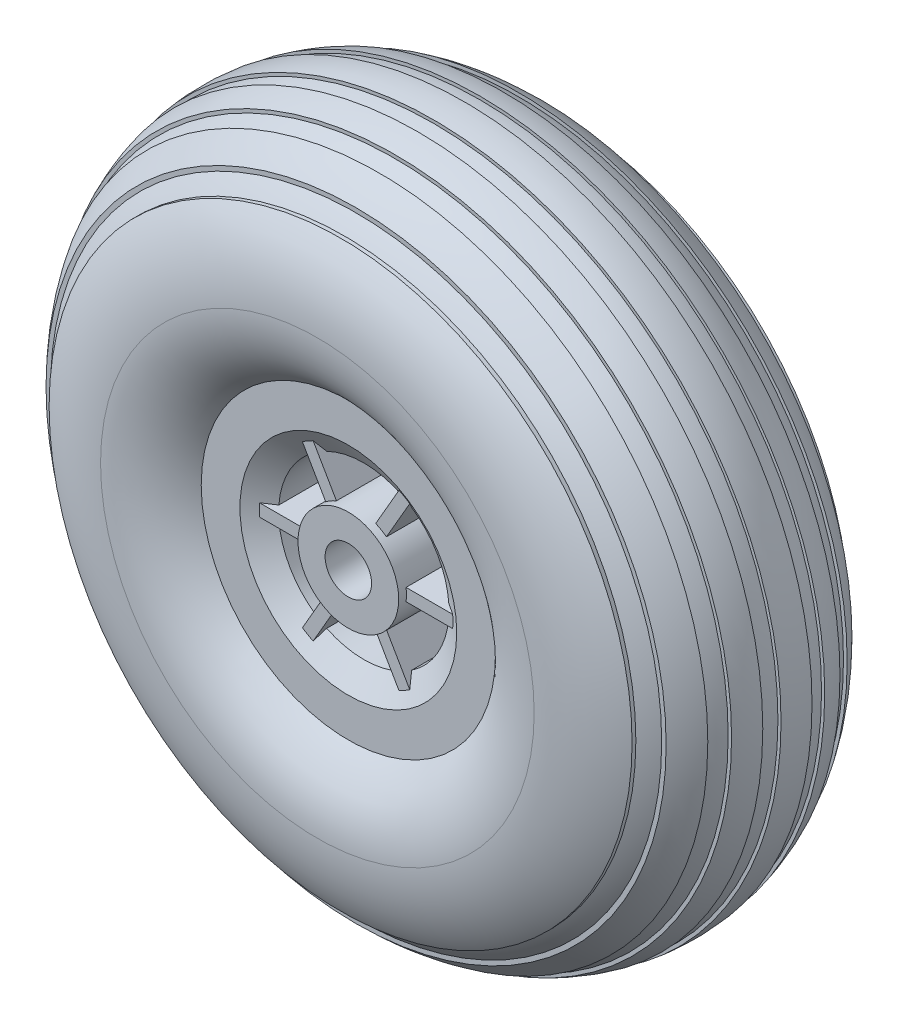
ISO-10303-21;
HEADER;
FILE_DESCRIPTION(('STEP AP214'),'2;1');
FILE_NAME('part.step','',(''),(''),'','','');
FILE_SCHEMA(('AUTOMOTIVE_DESIGN { 1 0 10303 214 1 1 1 1 }'));
ENDSEC;
DATA;
#1=APPLICATION_CONTEXT('core data for automotive mechanical design processes');
#2=APPLICATION_PROTOCOL_DEFINITION('international standard','automotive_design',2000,#1);
#3=PRODUCT_CONTEXT('',#1,'mechanical');
#4=PRODUCT('Part','Part','',(#3));
#5=PRODUCT_RELATED_PRODUCT_CATEGORY('part','',(#4));
#6=PRODUCT_DEFINITION_FORMATION('','',#4);
#7=PRODUCT_DEFINITION_CONTEXT('part definition',#1,'design');
#8=PRODUCT_DEFINITION('design','',#6,#7);
#9=PRODUCT_DEFINITION_SHAPE('','',#8);
#10=(LENGTH_UNIT() NAMED_UNIT(*) SI_UNIT(.MILLI.,.METRE.));
#11=(NAMED_UNIT(*) PLANE_ANGLE_UNIT() SI_UNIT($,.RADIAN.));
#12=(NAMED_UNIT(*) SI_UNIT($,.STERADIAN.) SOLID_ANGLE_UNIT());
#13=UNCERTAINTY_MEASURE_WITH_UNIT(LENGTH_MEASURE(1.E-05),#10,'distance_accuracy_value','');
#14=(GEOMETRIC_REPRESENTATION_CONTEXT(3) GLOBAL_UNCERTAINTY_ASSIGNED_CONTEXT((#13)) GLOBAL_UNIT_ASSIGNED_CONTEXT((#10,
#11,#12)) REPRESENTATION_CONTEXT('',''));
#15=CARTESIAN_POINT('',(0.,0.,0.));
#16=DIRECTION('',(0.,0.,1.));
#17=DIRECTION('',(1.,0.,0.));
#18=AXIS2_PLACEMENT_3D('',#15,#16,#17);
#19=CARTESIAN_POINT('',(0.,0.,0.));
#20=DIRECTION('',(0.,0.,-1.));
#21=DIRECTION('',(-1.,0.,0.));
#22=AXIS2_PLACEMENT_3D('',#19,#20,#21);
#23=TOROIDAL_SURFACE('',#22,14.,8.5);
#24=CARTESIAN_POINT('',(0.,0.,8.5));
#25=DIRECTION('',(0.,0.,-1.));
#26=DIRECTION('',(-1.,0.,0.));
#27=AXIS2_PLACEMENT_3D('',#24,#25,#26);
#28=CIRCLE('',#27,14.);
#29=CARTESIAN_POINT('',(-14.,0.,8.5));
#30=VERTEX_POINT('',#29);
#31=EDGE_CURVE('E1075',#30,#30,#28,.T.);
#32=ORIENTED_EDGE('',*,*,#31,.T.);
#33=EDGE_LOOP('',(#32));
#34=FACE_BOUND('',#33,.T.);
#35=CARTESIAN_POINT('',(0.,0.,7.));
#36=DIRECTION('',(0.,0.,1.));
#37=DIRECTION('',(1.,0.,0.));
#38=AXIS2_PLACEMENT_3D('',#35,#36,#37);
#39=CIRCLE('',#38,18.8218253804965);
#40=CARTESIAN_POINT('',(18.8218253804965,0.,7.));
#41=VERTEX_POINT('',#40);
#42=EDGE_CURVE('E1141',#41,#41,#39,.T.);
#43=ORIENTED_EDGE('',*,*,#42,.T.);
#44=EDGE_LOOP('',(#43));
#45=FACE_BOUND('',#44,.T.);
#46=ADVANCED_FACE('F48',(#34,#45),#23,.T.);
#47=CARTESIAN_POINT('',(0.,0.,4.5));
#48=DIRECTION('',(0.,0.,1.));
#49=DIRECTION('',(1.,0.,0.));
#50=AXIS2_PLACEMENT_3D('',#47,#48,#49);
#51=CIRCLE('',#50,21.211102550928);
#52=CARTESIAN_POINT('',(21.211102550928,0.,4.5));
#53=VERTEX_POINT('',#52);
#54=EDGE_CURVE('E1087',#53,#53,#51,.T.);
#55=ORIENTED_EDGE('',*,*,#54,.T.);
#56=EDGE_LOOP('',(#55));
#57=FACE_BOUND('',#56,.T.);
#58=CARTESIAN_POINT('',(0.,0.,6.));
#59=DIRECTION('',(0.,0.,1.));
#60=DIRECTION('',(1.,0.,0.));
#61=AXIS2_PLACEMENT_3D('',#58,#59,#60);
#62=CIRCLE('',#61,20.0207972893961);
#63=CARTESIAN_POINT('',(20.0207972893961,0.,6.));
#64=VERTEX_POINT('',#63);
#65=EDGE_CURVE('E1144',#64,#64,#62,.T.);
#66=ORIENTED_EDGE('',*,*,#65,.F.);
#67=EDGE_LOOP('',(#66));
#68=FACE_BOUND('',#67,.T.);
#69=ADVANCED_FACE('F1165',(#57,#68),#23,.T.);
#70=CARTESIAN_POINT('',(0.,0.,-1.));
#71=DIRECTION('',(0.,0.,1.));
#72=DIRECTION('',(1.,0.,0.));
#73=AXIS2_PLACEMENT_3D('',#70,#71,#72);
#74=CIRCLE('',#73,22.4409715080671);
#75=CARTESIAN_POINT('',(22.4409715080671,0.,-1.));
#76=VERTEX_POINT('',#75);
#77=EDGE_CURVE('E1096',#76,#76,#74,.T.);
#78=ORIENTED_EDGE('',*,*,#77,.T.);
#79=EDGE_LOOP('',(#78));
#80=FACE_BOUND('',#79,.T.);
#81=CARTESIAN_POINT('',(0.,0.,0.999999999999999));
#82=DIRECTION('',(0.,0.,1.));
#83=DIRECTION('',(1.,0.,0.));
#84=AXIS2_PLACEMENT_3D('',#81,#82,#83);
#85=CIRCLE('',#84,22.4409715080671);
#86=CARTESIAN_POINT('',(22.4409715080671,0.,0.999999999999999));
#87=VERTEX_POINT('',#86);
#88=EDGE_CURVE('E1126',#87,#87,#85,.T.);
#89=ORIENTED_EDGE('',*,*,#88,.F.);
#90=EDGE_LOOP('',(#89));
#91=FACE_BOUND('',#90,.T.);
#92=ADVANCED_FACE('F1172',(#80,#91),#23,.T.);
#93=CARTESIAN_POINT('',(0.,0.,3.5));
#94=DIRECTION('',(0.,0.,1.));
#95=DIRECTION('',(1.,0.,0.));
#96=AXIS2_PLACEMENT_3D('',#93,#94,#95);
#97=CIRCLE('',#96,21.7459666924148);
#98=CARTESIAN_POINT('',(21.7459666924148,0.,3.5));
#99=VERTEX_POINT('',#98);
#100=EDGE_CURVE('E1078',#99,#99,#97,.T.);
#101=ORIENTED_EDGE('',*,*,#100,.F.);
#102=EDGE_LOOP('',(#101));
#103=FACE_BOUND('',#102,.T.);
#104=CARTESIAN_POINT('',(0.,0.,2.));
#105=DIRECTION('',(0.,0.,1.));
#106=DIRECTION('',(1.,0.,0.));
#107=AXIS2_PLACEMENT_3D('',#104,#105,#106);
#108=CIRCLE('',#107,22.2613558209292);
#109=CARTESIAN_POINT('',(22.2613558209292,0.,2.));
#110=VERTEX_POINT('',#109);
#111=EDGE_CURVE('E1135',#110,#110,#108,.T.);
#112=ORIENTED_EDGE('',*,*,#111,.T.);
#113=EDGE_LOOP('',(#112));
#114=FACE_BOUND('',#113,.T.);
#115=ADVANCED_FACE('F1178',(#103,#114),#23,.T.);
#116=CARTESIAN_POINT('',(0.,0.,-8.5));
#117=DIRECTION('',(0.,0.,-1.));
#118=DIRECTION('',(-1.,0.,0.));
#119=AXIS2_PLACEMENT_3D('',#116,#117,#118);
#120=CIRCLE('',#119,14.);
#121=CARTESIAN_POINT('',(-14.,0.,-8.5));
#122=VERTEX_POINT('',#121);
#123=EDGE_CURVE('E1072',#122,#122,#120,.T.);
#124=ORIENTED_EDGE('',*,*,#123,.F.);
#125=EDGE_LOOP('',(#124));
#126=FACE_BOUND('',#125,.T.);
#127=CARTESIAN_POINT('',(0.,0.,-7.));
#128=DIRECTION('',(0.,0.,1.));
#129=DIRECTION('',(1.,0.,0.));
#130=AXIS2_PLACEMENT_3D('',#127,#128,#129);
#131=CIRCLE('',#130,18.8218253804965);
#132=CARTESIAN_POINT('',(18.8218253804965,0.,-7.));
#133=VERTEX_POINT('',#132);
#134=EDGE_CURVE('E1117',#133,#133,#131,.T.);
#135=ORIENTED_EDGE('',*,*,#134,.F.);
#136=EDGE_LOOP('',(#135));
#137=FACE_BOUND('',#136,.T.);
#138=ADVANCED_FACE('F1168',(#126,#137),#23,.T.);
#139=CARTESIAN_POINT('',(0.,0.,-4.5));
#140=DIRECTION('',(0.,0.,1.));
#141=DIRECTION('',(1.,0.,0.));
#142=AXIS2_PLACEMENT_3D('',#139,#140,#141);
#143=CIRCLE('',#142,21.211102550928);
#144=CARTESIAN_POINT('',(21.211102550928,0.,-4.5));
#145=VERTEX_POINT('',#144);
#146=EDGE_CURVE('E1105',#145,#145,#143,.T.);
#147=ORIENTED_EDGE('',*,*,#146,.F.);
#148=EDGE_LOOP('',(#147));
#149=FACE_BOUND('',#148,.T.);
#150=CARTESIAN_POINT('',(0.,0.,-6.));
#151=DIRECTION('',(0.,0.,1.));
#152=DIRECTION('',(1.,0.,0.));
#153=AXIS2_PLACEMENT_3D('',#150,#151,#152);
#154=CIRCLE('',#153,20.0207972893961);
#155=CARTESIAN_POINT('',(20.0207972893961,0.,-6.));
#156=VERTEX_POINT('',#155);
#157=EDGE_CURVE('E1120',#156,#156,#154,.T.);
#158=ORIENTED_EDGE('',*,*,#157,.T.);
#159=EDGE_LOOP('',(#158));
#160=FACE_BOUND('',#159,.T.);
#161=ADVANCED_FACE('F1177',(#149,#160),#23,.T.);
#162=CARTESIAN_POINT('',(0.,0.,-2.));
#163=DIRECTION('',(0.,0.,1.));
#164=DIRECTION('',(1.,0.,0.));
#165=AXIS2_PLACEMENT_3D('',#162,#163,#164);
#166=CIRCLE('',#165,22.2613558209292);
#167=CARTESIAN_POINT('',(22.2613558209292,0.,-2.));
#168=VERTEX_POINT('',#167);
#169=EDGE_CURVE('E1093',#168,#168,#166,.T.);
#170=ORIENTED_EDGE('',*,*,#169,.F.);
#171=EDGE_LOOP('',(#170));
#172=FACE_BOUND('',#171,.T.);
#173=CARTESIAN_POINT('',(0.,0.,-3.5));
#174=DIRECTION('',(0.,0.,1.));
#175=DIRECTION('',(1.,0.,0.));
#176=AXIS2_PLACEMENT_3D('',#173,#174,#175);
#177=CIRCLE('',#176,21.7459666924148);
#178=CARTESIAN_POINT('',(21.7459666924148,0.,-3.5));
#179=VERTEX_POINT('',#178);
#180=EDGE_CURVE('E1108',#179,#179,#177,.T.);
#181=ORIENTED_EDGE('',*,*,#180,.T.);
#182=EDGE_LOOP('',(#181));
#183=FACE_BOUND('',#182,.T.);
#184=ADVANCED_FACE('F1180',(#172,#183),#23,.T.);
#185=CARTESIAN_POINT('',(0.,3.25,2.));
#186=DIRECTION('',(0.,0.,-1.));
#187=DIRECTION('',(-1.,0.,0.));
#188=AXIS2_PLACEMENT_3D('',#185,#186,#187);
#189=PLANE('',#188);
#190=DIRECTION('',(0.50000000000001,-0.866025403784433,0.));
#191=VECTOR('',#190,1.);
#192=CARTESIAN_POINT('',(2.40358983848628,-4.96313972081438,2.));
#193=LINE('',#192,#191);
#194=CARTESIAN_POINT('',(1.26623518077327,-2.9931836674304,2.));
#195=VERTEX_POINT('',#194);
#196=CARTESIAN_POINT('',(2.39630746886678,-4.9505262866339,2.));
#197=VERTEX_POINT('',#196);
#198=EDGE_CURVE('E446',#195,#197,#193,.T.);
#199=ORIENTED_EDGE('',*,*,#198,.F.);
#200=CARTESIAN_POINT('',(0.,0.,2.));
#201=DIRECTION('',(0.,0.,1.));
#202=DIRECTION('',(1.,0.,0.));
#203=AXIS2_PLACEMENT_3D('',#200,#201,#202);
#204=CIRCLE('',#203,3.25);
#205=CARTESIAN_POINT('',(-1.26623518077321,-2.99318366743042,2.));
#206=VERTEX_POINT('',#205);
#207=EDGE_CURVE('E2010',#206,#195,#204,.T.);
#208=ORIENTED_EDGE('',*,*,#207,.F.);
#209=DIRECTION('',(-0.499999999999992,-0.866025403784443,0.));
#210=VECTOR('',#209,1.);
#211=CARTESIAN_POINT('',(-2.40358983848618,-4.96313972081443,2.));
#212=LINE('',#211,#210);
#213=CARTESIAN_POINT('',(-2.39630746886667,-4.95052628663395,2.));
#214=VERTEX_POINT('',#213);
#215=EDGE_CURVE('E1030',#206,#214,#212,.T.);
#216=ORIENTED_EDGE('',*,*,#215,.T.);
#217=CARTESIAN_POINT('',(0.,0.,2.));
#218=DIRECTION('',(0.,0.,1.));
#219=DIRECTION('',(1.,0.,0.));
#220=AXIS2_PLACEMENT_3D('',#217,#218,#219);
#221=CIRCLE('',#220,5.5);
#222=EDGE_CURVE('E1982',#214,#197,#221,.T.);
#223=ORIENTED_EDGE('',*,*,#222,.T.);
#224=EDGE_LOOP('',(#199,#208,#216,#223));
#225=FACE_BOUND('',#224,.T.);
#226=ADVANCED_FACE('F1190',(#225),#189,.F.);
#227=CARTESIAN_POINT('',(0.,0.,0.));
#228=DIRECTION('',(0.,0.,1.));
#229=DIRECTION('',(1.,0.,0.));
#230=AXIS2_PLACEMENT_3D('',#227,#228,#229);
#231=CYLINDRICAL_SURFACE('',#230,5.5);
#232=DIRECTION('',(0.,0.,1.));
#233=VECTOR('',#232,1.);
#234=CARTESIAN_POINT('',(2.39630746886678,-4.9505262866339,0.));
#235=LINE('',#234,#233);
#236=CARTESIAN_POINT('',(2.39630746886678,-4.9505262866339,5.5));
#237=VERTEX_POINT('',#236);
#238=EDGE_CURVE('E427',#197,#237,#235,.T.);
#239=ORIENTED_EDGE('',*,*,#238,.F.);
#240=ORIENTED_EDGE('',*,*,#222,.F.);
#241=DIRECTION('',(0.,0.,1.));
#242=VECTOR('',#241,1.);
#243=CARTESIAN_POINT('',(-2.39630746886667,-4.95052628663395,0.));
#244=LINE('',#243,#242);
#245=CARTESIAN_POINT('',(-2.39630746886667,-4.95052628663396,5.5));
#246=VERTEX_POINT('',#245);
#247=EDGE_CURVE('E430',#214,#246,#244,.T.);
#248=ORIENTED_EDGE('',*,*,#247,.T.);
#249=CARTESIAN_POINT('',(0.,0.,5.5));
#250=DIRECTION('',(0.,0.,1.));
#251=DIRECTION('',(1.,0.,0.));
#252=AXIS2_PLACEMENT_3D('',#249,#250,#251);
#253=CIRCLE('',#252,5.5);
#254=EDGE_CURVE('E423',#246,#237,#253,.T.);
#255=ORIENTED_EDGE('',*,*,#254,.T.);
#256=EDGE_LOOP('',(#239,#240,#248,#255));
#257=FACE_BOUND('',#256,.T.);
#258=ADVANCED_FACE('F424',(#257),#231,.F.);
#259=DIRECTION('',(-0.499999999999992,-0.866025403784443,0.));
#260=VECTOR('',#259,1.);
#261=CARTESIAN_POINT('',(-3.09641016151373,-4.56313972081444,2.));
#262=LINE('',#261,#260);
#263=CARTESIAN_POINT('',(-1.95905550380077,-2.59318366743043,2.));
#264=VERTEX_POINT('',#263);
#265=CARTESIAN_POINT('',(-3.08912779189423,-4.55052628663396,2.));
#266=VERTEX_POINT('',#265);
#267=EDGE_CURVE('E1031',#264,#266,#262,.T.);
#268=ORIENTED_EDGE('',*,*,#267,.F.);
#269=CARTESIAN_POINT('',(-3.22529068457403,-0.4,2.));
#270=VERTEX_POINT('',#269);
#271=EDGE_CURVE('E2008',#270,#264,#204,.T.);
#272=ORIENTED_EDGE('',*,*,#271,.F.);
#273=DIRECTION('',(-1.,0.,0.));
#274=VECTOR('',#273,1.);
#275=CARTESIAN_POINT('',(-5.5,-0.4,2.));
#276=LINE('',#275,#274);
#277=CARTESIAN_POINT('',(-5.48543526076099,-0.4,2.));
#278=VERTEX_POINT('',#277);
#279=EDGE_CURVE('E990',#270,#278,#276,.T.);
#280=ORIENTED_EDGE('',*,*,#279,.T.);
#281=EDGE_CURVE('E1983',#278,#266,#221,.T.);
#282=ORIENTED_EDGE('',*,*,#281,.T.);
#283=EDGE_LOOP('',(#268,#272,#280,#282));
#284=FACE_BOUND('',#283,.T.);
#285=ADVANCED_FACE('F1197',(#284),#189,.F.);
#286=DIRECTION('',(0.,0.,1.));
#287=VECTOR('',#286,1.);
#288=CARTESIAN_POINT('',(-3.08912779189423,-4.55052628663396,0.));
#289=LINE('',#288,#287);
#290=CARTESIAN_POINT('',(-3.08912779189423,-4.55052628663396,5.5));
#291=VERTEX_POINT('',#290);
#292=EDGE_CURVE('E452',#266,#291,#289,.T.);
#293=ORIENTED_EDGE('',*,*,#292,.F.);
#294=ORIENTED_EDGE('',*,*,#281,.F.);
#295=DIRECTION('',(0.,0.,1.));
#296=VECTOR('',#295,1.);
#297=CARTESIAN_POINT('',(-5.48543526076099,-0.4,0.));
#298=LINE('',#297,#296);
#299=CARTESIAN_POINT('',(-5.48543526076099,-0.4,5.5));
#300=VERTEX_POINT('',#299);
#301=EDGE_CURVE('E457',#278,#300,#298,.T.);
#302=ORIENTED_EDGE('',*,*,#301,.T.);
#303=EDGE_CURVE('E432',#300,#291,#253,.T.);
#304=ORIENTED_EDGE('',*,*,#303,.T.);
#305=EDGE_LOOP('',(#293,#294,#302,#304));
#306=FACE_BOUND('',#305,.T.);
#307=ADVANCED_FACE('F1530',(#306),#231,.F.);
#308=DIRECTION('',(-1.,0.,0.));
#309=VECTOR('',#308,1.);
#310=CARTESIAN_POINT('',(-5.5,0.4,2.));
#311=LINE('',#310,#309);
#312=CARTESIAN_POINT('',(-3.22529068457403,0.4,2.));
#313=VERTEX_POINT('',#312);
#314=CARTESIAN_POINT('',(-5.48543526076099,0.4,2.));
#315=VERTEX_POINT('',#314);
#316=EDGE_CURVE('E991',#313,#315,#311,.T.);
#317=ORIENTED_EDGE('',*,*,#316,.F.);
#318=CARTESIAN_POINT('',(-1.9590555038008,2.5931836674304,2.));
#319=VERTEX_POINT('',#318);
#320=EDGE_CURVE('E2006',#319,#313,#204,.T.);
#321=ORIENTED_EDGE('',*,*,#320,.F.);
#322=DIRECTION('',(-0.500000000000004,0.866025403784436,0.));
#323=VECTOR('',#322,1.);
#324=CARTESIAN_POINT('',(-3.0964101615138,4.5631397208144,2.));
#325=LINE('',#324,#323);
#326=CARTESIAN_POINT('',(-3.08912779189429,4.55052628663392,2.));
#327=VERTEX_POINT('',#326);
#328=EDGE_CURVE('E950',#319,#327,#325,.T.);
#329=ORIENTED_EDGE('',*,*,#328,.T.);
#330=EDGE_CURVE('E1985',#327,#315,#221,.T.);
#331=ORIENTED_EDGE('',*,*,#330,.T.);
#332=EDGE_LOOP('',(#317,#321,#329,#331));
#333=FACE_BOUND('',#332,.T.);
#334=ADVANCED_FACE('F1539',(#333),#189,.F.);
#335=DIRECTION('',(0.,0.,1.));
#336=VECTOR('',#335,1.);
#337=CARTESIAN_POINT('',(-5.48543526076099,0.4,0.));
#338=LINE('',#337,#336);
#339=CARTESIAN_POINT('',(-5.48543526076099,0.4,5.5));
#340=VERTEX_POINT('',#339);
#341=EDGE_CURVE('E459',#315,#340,#338,.T.);
#342=ORIENTED_EDGE('',*,*,#341,.F.);
#343=ORIENTED_EDGE('',*,*,#330,.F.);
#344=DIRECTION('',(0.,0.,1.));
#345=VECTOR('',#344,1.);
#346=CARTESIAN_POINT('',(-3.08912779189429,4.55052628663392,0.));
#347=LINE('',#346,#345);
#348=CARTESIAN_POINT('',(-3.08912779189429,4.55052628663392,5.5));
#349=VERTEX_POINT('',#348);
#350=EDGE_CURVE('E464',#327,#349,#347,.T.);
#351=ORIENTED_EDGE('',*,*,#350,.T.);
#352=EDGE_CURVE('E2035',#349,#340,#253,.T.);
#353=ORIENTED_EDGE('',*,*,#352,.T.);
#354=EDGE_LOOP('',(#342,#343,#351,#353));
#355=FACE_BOUND('',#354,.T.);
#356=ADVANCED_FACE('F1547',(#355),#231,.F.);
#357=DIRECTION('',(-0.500000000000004,0.866025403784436,0.));
#358=VECTOR('',#357,1.);
#359=CARTESIAN_POINT('',(-2.40358983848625,4.9631397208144,2.));
#360=LINE('',#359,#358);
#361=CARTESIAN_POINT('',(-1.26623518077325,2.99318366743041,2.));
#362=VERTEX_POINT('',#361);
#363=CARTESIAN_POINT('',(-2.39630746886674,4.95052628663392,2.));
#364=VERTEX_POINT('',#363);
#365=EDGE_CURVE('E951',#362,#364,#360,.T.);
#366=ORIENTED_EDGE('',*,*,#365,.F.);
#367=CARTESIAN_POINT('',(1.26623518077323,2.99318366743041,2.));
#368=VERTEX_POINT('',#367);
#369=EDGE_CURVE('E570',#368,#362,#204,.T.);
#370=ORIENTED_EDGE('',*,*,#369,.F.);
#371=DIRECTION('',(0.499999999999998,0.86602540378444,0.));
#372=VECTOR('',#371,1.);
#373=CARTESIAN_POINT('',(2.40358983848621,4.96313972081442,2.));
#374=LINE('',#373,#372);
#375=CARTESIAN_POINT('',(2.39630746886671,4.95052628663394,2.));
#376=VERTEX_POINT('',#375);
#377=EDGE_CURVE('E910',#368,#376,#374,.T.);
#378=ORIENTED_EDGE('',*,*,#377,.T.);
#379=EDGE_CURVE('E574',#376,#364,#221,.T.);
#380=ORIENTED_EDGE('',*,*,#379,.T.);
#381=EDGE_LOOP('',(#366,#370,#378,#380));
#382=FACE_BOUND('',#381,.T.);
#383=ADVANCED_FACE('F1555',(#382),#189,.F.);
#384=DIRECTION('',(0.,0.,1.));
#385=VECTOR('',#384,1.);
#386=CARTESIAN_POINT('',(-2.39630746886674,4.95052628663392,0.));
#387=LINE('',#386,#385);
#388=CARTESIAN_POINT('',(-2.39630746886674,4.95052628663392,5.5));
#389=VERTEX_POINT('',#388);
#390=EDGE_CURVE('E466',#364,#389,#387,.T.);
#391=ORIENTED_EDGE('',*,*,#390,.F.);
#392=ORIENTED_EDGE('',*,*,#379,.F.);
#393=DIRECTION('',(0.,0.,1.));
#394=VECTOR('',#393,1.);
#395=CARTESIAN_POINT('',(2.39630746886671,4.95052628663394,0.));
#396=LINE('',#395,#394);
#397=CARTESIAN_POINT('',(2.39630746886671,4.95052628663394,5.5));
#398=VERTEX_POINT('',#397);
#399=EDGE_CURVE('E471',#376,#398,#396,.T.);
#400=ORIENTED_EDGE('',*,*,#399,.T.);
#401=EDGE_CURVE('E578',#398,#389,#253,.T.);
#402=ORIENTED_EDGE('',*,*,#401,.T.);
#403=EDGE_LOOP('',(#391,#392,#400,#402));
#404=FACE_BOUND('',#403,.T.);
#405=ADVANCED_FACE('F1563',(#404),#231,.F.);
#406=DIRECTION('',(0.499999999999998,0.86602540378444,0.));
#407=VECTOR('',#406,1.);
#408=CARTESIAN_POINT('',(3.09641016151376,4.56313972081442,2.));
#409=LINE('',#408,#407);
#410=CARTESIAN_POINT('',(1.95905550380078,2.59318366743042,2.));
#411=VERTEX_POINT('',#410);
#412=CARTESIAN_POINT('',(3.08912779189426,4.55052628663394,2.));
#413=VERTEX_POINT('',#412);
#414=EDGE_CURVE('E911',#411,#413,#409,.T.);
#415=ORIENTED_EDGE('',*,*,#414,.F.);
#416=CARTESIAN_POINT('',(3.22529068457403,0.4,2.));
#417=VERTEX_POINT('',#416);
#418=EDGE_CURVE('E567',#417,#411,#204,.T.);
#419=ORIENTED_EDGE('',*,*,#418,.F.);
#420=DIRECTION('',(1.,0.,0.));
#421=VECTOR('',#420,1.);
#422=CARTESIAN_POINT('',(5.5,0.4,2.));
#423=LINE('',#422,#421);
#424=CARTESIAN_POINT('',(5.48543526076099,0.4,2.));
#425=VERTEX_POINT('',#424);
#426=EDGE_CURVE('E870',#417,#425,#423,.T.);
#427=ORIENTED_EDGE('',*,*,#426,.T.);
#428=EDGE_CURVE('E572',#425,#413,#221,.T.);
#429=ORIENTED_EDGE('',*,*,#428,.T.);
#430=EDGE_LOOP('',(#415,#419,#427,#429));
#431=FACE_BOUND('',#430,.T.);
#432=ADVANCED_FACE('F1571',(#431),#189,.F.);
#433=DIRECTION('',(0.,0.,1.));
#434=VECTOR('',#433,1.);
#435=CARTESIAN_POINT('',(3.08912779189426,4.55052628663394,0.));
#436=LINE('',#435,#434);
#437=CARTESIAN_POINT('',(3.08912779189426,4.55052628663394,5.5));
#438=VERTEX_POINT('',#437);
#439=EDGE_CURVE('E473',#413,#438,#436,.T.);
#440=ORIENTED_EDGE('',*,*,#439,.F.);
#441=ORIENTED_EDGE('',*,*,#428,.F.);
#442=DIRECTION('',(0.,0.,1.));
#443=VECTOR('',#442,1.);
#444=CARTESIAN_POINT('',(5.48543526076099,0.4,0.));
#445=LINE('',#444,#443);
#446=CARTESIAN_POINT('',(5.48543526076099,0.4,5.5));
#447=VERTEX_POINT('',#446);
#448=EDGE_CURVE('E862',#425,#447,#445,.T.);
#449=ORIENTED_EDGE('',*,*,#448,.T.);
#450=EDGE_CURVE('E576',#447,#438,#253,.T.);
#451=ORIENTED_EDGE('',*,*,#450,.T.);
#452=EDGE_LOOP('',(#440,#441,#449,#451));
#453=FACE_BOUND('',#452,.T.);
#454=ADVANCED_FACE('F1579',(#453),#231,.F.);
#455=CARTESIAN_POINT('',(0.,0.,6.5));
#456=DIRECTION('',(0.,0.,1.));
#457=DIRECTION('',(1.,0.,0.));
#458=AXIS2_PLACEMENT_3D('',#455,#456,#457);
#459=CONICAL_SURFACE('',#458,7.,0.982793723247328);
#460=CARTESIAN_POINT('',(0.,0.,6.5));
#461=DIRECTION('',(0.,0.,1.));
#462=DIRECTION('',(1.,0.,0.));
#463=AXIS2_PLACEMENT_3D('',#460,#461,#462);
#464=CIRCLE('',#463,7.);
#465=CARTESIAN_POINT('',(7.,0.,6.5));
#466=VERTEX_POINT('',#465);
#467=EDGE_CURVE('E579',#466,#466,#464,.T.);
#468=ORIENTED_EDGE('',*,*,#467,.T.);
#469=EDGE_LOOP('',(#468));
#470=FACE_BOUND('',#469,.T.);
#471=CARTESIAN_POINT('',(3.08912779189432,-4.5505262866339,5.5));
#472=VERTEX_POINT('',#471);
#473=CARTESIAN_POINT('',(5.48543526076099,-0.4,5.5));
#474=VERTEX_POINT('',#473);
#475=EDGE_CURVE('E433',#472,#474,#253,.T.);
#476=ORIENTED_EDGE('',*,*,#475,.F.);
#477=CARTESIAN_POINT('',(3.08897739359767,-4.55026578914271,5.4998));
#478=CARTESIAN_POINT('',(3.15167922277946,-4.65886854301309,5.58318272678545));
#479=CARTESIAN_POINT('',(3.21437817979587,-4.76746632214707,5.66657409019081));
#480=CARTESIAN_POINT('',(3.33977034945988,-4.98465193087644,5.83337409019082));
#481=CARTESIAN_POINT('',(3.4024635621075,-5.09323976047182,5.91678272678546));
#482=CARTESIAN_POINT('',(3.46515390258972,-5.20182261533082,6.0002));
#483=B_SPLINE_CURVE_WITH_KNOTS('',3,(#477,#478,#479,#480,#481,#482),.UNSPECIFIED.,.F.,.F.,(4,2,
4),(0.,0.451784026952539,0.903568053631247),.UNSPECIFIED.);
#484=CARTESIAN_POINT('',(3.4650035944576,-5.20156227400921,6.));
#485=VERTEX_POINT('',#484);
#486=EDGE_CURVE('E63',#472,#485,#483,.T.);
#487=ORIENTED_EDGE('',*,*,#486,.T.);
#488=CARTESIAN_POINT('',(0.,0.,6.));
#489=DIRECTION('',(0.,0.,1.));
#490=DIRECTION('',(0.,-1.,0.));
#491=AXIS2_PLACEMENT_3D('',#488,#489,#490);
#492=CIRCLE('',#491,6.25);
#493=CARTESIAN_POINT('',(2.77218327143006,-5.60156227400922,6.));
#494=VERTEX_POINT('',#493);
#495=EDGE_CURVE('E67',#485,#494,#492,.F.);
#496=ORIENTED_EDGE('',*,*,#495,.T.);
#497=CARTESIAN_POINT('',(2.39615707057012,-4.95026578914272,5.4998));
#498=CARTESIAN_POINT('',(2.45885889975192,-5.0588685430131,5.58318272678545));
#499=CARTESIAN_POINT('',(2.52155785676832,-5.16746632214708,5.66657409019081));
#500=CARTESIAN_POINT('',(2.64695002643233,-5.38465193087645,5.83337409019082));
#501=CARTESIAN_POINT('',(2.70964323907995,-5.49323976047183,5.91678272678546));
#502=CARTESIAN_POINT('',(2.77233357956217,-5.60182261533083,6.0002));
#503=B_SPLINE_CURVE_WITH_KNOTS('',3,(#497,#498,#499,#500,#501,#502),.UNSPECIFIED.,.F.,.F.,(4,2,
4),(0.,0.451784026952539,0.903568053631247),.UNSPECIFIED.);
#504=EDGE_CURVE('E435',#237,#494,#503,.T.);
#505=ORIENTED_EDGE('',*,*,#504,.F.);
#506=ORIENTED_EDGE('',*,*,#254,.F.);
#507=CARTESIAN_POINT('',(-2.39615707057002,-4.95026578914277,5.4998));
#508=CARTESIAN_POINT('',(-2.45885889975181,-5.05886854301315,5.58318272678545));
#509=CARTESIAN_POINT('',(-2.52155785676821,-5.16746632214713,5.66657409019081));
#510=CARTESIAN_POINT('',(-2.64695002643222,-5.3846519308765,5.83337409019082));
#511=CARTESIAN_POINT('',(-2.70964323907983,-5.49323976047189,5.91678272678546));
#512=CARTESIAN_POINT('',(-2.77233357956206,-5.60182261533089,6.0002));
#513=B_SPLINE_CURVE_WITH_KNOTS('',3,(#507,#508,#509,#510,#511,#512),.UNSPECIFIED.,.F.,.F.,(4,2,
4),(0.,0.451784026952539,0.903568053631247),.UNSPECIFIED.);
#514=CARTESIAN_POINT('',(-2.77218327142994,-5.60156227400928,6.));
#515=VERTEX_POINT('',#514);
#516=EDGE_CURVE('E1005',#246,#515,#513,.T.);
#517=ORIENTED_EDGE('',*,*,#516,.T.);
#518=CARTESIAN_POINT('',(0.,0.,6.));
#519=DIRECTION('',(0.,0.,1.));
#520=DIRECTION('',(0.,-1.,0.));
#521=AXIS2_PLACEMENT_3D('',#518,#519,#520);
#522=CIRCLE('',#521,6.25);
#523=CARTESIAN_POINT('',(-3.4650035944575,-5.20156227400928,6.));
#524=VERTEX_POINT('',#523);
#525=EDGE_CURVE('E998',#515,#524,#522,.F.);
#526=ORIENTED_EDGE('',*,*,#525,.T.);
#527=CARTESIAN_POINT('',(-3.08897739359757,-4.55026578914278,5.4998));
#528=CARTESIAN_POINT('',(-3.15167922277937,-4.65886854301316,5.58318272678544));
#529=CARTESIAN_POINT('',(-3.21437817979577,-4.76746632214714,5.66657409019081));
#530=CARTESIAN_POINT('',(-3.33977034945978,-4.98465193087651,5.83337409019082));
#531=CARTESIAN_POINT('',(-3.40246356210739,-5.0932397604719,5.91678272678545));
#532=CARTESIAN_POINT('',(-3.46515390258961,-5.2018226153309,6.0002));
#533=B_SPLINE_CURVE_WITH_KNOTS('',3,(#527,#528,#529,#530,#531,#532),.UNSPECIFIED.,.F.,.F.,(4,2,
4),(0.,0.451784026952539,0.903568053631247),.UNSPECIFIED.);
#534=EDGE_CURVE('E1024',#291,#524,#533,.T.);
#535=ORIENTED_EDGE('',*,*,#534,.F.);
#536=ORIENTED_EDGE('',*,*,#303,.F.);
#537=CARTESIAN_POINT('',(-3.00465687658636,-0.4,3.85411018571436));
#538=CARTESIAN_POINT('',(-3.23837589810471,-0.4,4.00858704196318));
#539=CARTESIAN_POINT('',(-3.47197742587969,-0.4,4.16324135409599));
#540=CARTESIAN_POINT('',(-3.9390195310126,-0.4,4.47279262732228));
#541=CARTESIAN_POINT('',(-4.17246010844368,-0.4,4.62768958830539));
#542=CARTESIAN_POINT('',(-4.87265156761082,-0.4,5.09257611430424));
#543=CARTESIAN_POINT('',(-5.33927239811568,-0.4,5.40276146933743));
#544=CARTESIAN_POINT('',(-6.76541369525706,-0.4,6.35126673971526));
#545=CARTESIAN_POINT('',(-7.72469996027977,-0.4,6.98993867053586));
#546=CARTESIAN_POINT('',(-9.16350154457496,-0.4,7.9481392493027));
#547=CARTESIAN_POINT('',(-9.64308097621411,-0.4,8.2675716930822));
#548=CARTESIAN_POINT('',(-10.6022065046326,-0.4,8.90648661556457));
#549=CARTESIAN_POINT('',(-11.0817526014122,-0.4,9.22596909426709));
#550=CARTESIAN_POINT('',(-11.5612867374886,-0.4,9.54546954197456));
#551=B_SPLINE_CURVE_WITH_KNOTS('',3,(#537,#538,#539,#540,#541,#542,#543,#544,#545,#546,#547,
#548,#549,#550),.UNSPECIFIED.,.F.,.F.,(4,2,2,2,2,2,4),(0.,0.840469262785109,1.68093814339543,
3.36187510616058,6.81921313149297,8.54788362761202,10.2765541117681),.UNSPECIFIED.);
#552=CARTESIAN_POINT('',(-6.23718686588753,-0.4,6.));
#553=VERTEX_POINT('',#552);
#554=EDGE_CURVE('E965',#300,#553,#551,.T.);
#555=ORIENTED_EDGE('',*,*,#554,.T.);
#556=CARTESIAN_POINT('',(0.,0.,6.));
#557=DIRECTION('',(0.,0.,1.));
#558=DIRECTION('',(1.,0.,0.));
#559=AXIS2_PLACEMENT_3D('',#556,#557,#558);
#560=CIRCLE('',#559,6.25);
#561=CARTESIAN_POINT('',(-6.23718686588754,0.4,6.));
#562=VERTEX_POINT('',#561);
#563=EDGE_CURVE('E958',#553,#562,#560,.F.);
#564=ORIENTED_EDGE('',*,*,#563,.T.);
#565=CARTESIAN_POINT('',(-3.00465687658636,0.4,3.85411018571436));
#566=CARTESIAN_POINT('',(-3.23837589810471,0.4,4.00858704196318));
#567=CARTESIAN_POINT('',(-3.47197742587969,0.4,4.16324135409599));
#568=CARTESIAN_POINT('',(-3.9390195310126,0.4,4.47279262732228));
#569=CARTESIAN_POINT('',(-4.17246010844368,0.4,4.62768958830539));
#570=CARTESIAN_POINT('',(-4.87265156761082,0.4,5.09257611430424));
#571=CARTESIAN_POINT('',(-5.33927239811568,0.4,5.40276146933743));
#572=CARTESIAN_POINT('',(-6.76541369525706,0.4,6.35126673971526));
#573=CARTESIAN_POINT('',(-7.72469996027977,0.4,6.98993867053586));
#574=CARTESIAN_POINT('',(-9.16350154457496,0.4,7.9481392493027));
#575=CARTESIAN_POINT('',(-9.64308097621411,0.4,8.2675716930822));
#576=CARTESIAN_POINT('',(-10.6022065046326,0.4,8.90648661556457));
#577=CARTESIAN_POINT('',(-11.0817526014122,0.4,9.22596909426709));
#578=CARTESIAN_POINT('',(-11.5612867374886,0.4,9.54546954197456));
#579=B_SPLINE_CURVE_WITH_KNOTS('',3,(#565,#566,#567,#568,#569,#570,#571,#572,#573,#574,#575,
#576,#577,#578),.UNSPECIFIED.,.F.,.F.,(4,2,2,2,2,2,4),(0.,0.840469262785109,1.68093814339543,
3.36187510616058,6.81921313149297,8.54788362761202,10.2765541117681),.UNSPECIFIED.);
#580=EDGE_CURVE('E984',#340,#562,#579,.T.);
#581=ORIENTED_EDGE('',*,*,#580,.F.);
#582=ORIENTED_EDGE('',*,*,#352,.F.);
#583=CARTESIAN_POINT('',(-3.08897739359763,4.55026578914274,5.4998));
#584=CARTESIAN_POINT('',(-3.15167922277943,4.65886854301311,5.58318272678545));
#585=CARTESIAN_POINT('',(-3.21437817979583,4.7674663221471,5.66657409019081));
#586=CARTESIAN_POINT('',(-3.33977034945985,4.98465193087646,5.83337409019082));
#587=CARTESIAN_POINT('',(-3.40246356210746,5.09323976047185,5.91678272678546));
#588=CARTESIAN_POINT('',(-3.46515390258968,5.20182261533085,6.0002));
#589=B_SPLINE_CURVE_WITH_KNOTS('',3,(#583,#584,#585,#586,#587,#588),.UNSPECIFIED.,.F.,.F.,(4,2,
4),(0.,0.451784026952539,0.903568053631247),.UNSPECIFIED.);
#590=CARTESIAN_POINT('',(-3.46500359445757,5.20156227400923,6.));
#591=VERTEX_POINT('',#590);
#592=EDGE_CURVE('E925',#349,#591,#589,.T.);
#593=ORIENTED_EDGE('',*,*,#592,.T.);
#594=CARTESIAN_POINT('',(0.,0.,6.));
#595=DIRECTION('',(0.,0.,1.));
#596=DIRECTION('',(0.,-1.,0.));
#597=AXIS2_PLACEMENT_3D('',#594,#595,#596);
#598=CIRCLE('',#597,6.25);
#599=CARTESIAN_POINT('',(-2.77218327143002,5.60156227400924,6.));
#600=VERTEX_POINT('',#599);
#601=EDGE_CURVE('E918',#591,#600,#598,.F.);
#602=ORIENTED_EDGE('',*,*,#601,.T.);
#603=CARTESIAN_POINT('',(-2.39615707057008,4.95026578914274,5.4998));
#604=CARTESIAN_POINT('',(-2.45885889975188,5.05886854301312,5.58318272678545));
#605=CARTESIAN_POINT('',(-2.52155785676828,5.1674663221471,5.66657409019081));
#606=CARTESIAN_POINT('',(-2.6469500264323,5.38465193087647,5.83337409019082));
#607=CARTESIAN_POINT('',(-2.70964323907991,5.49323976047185,5.91678272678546));
#608=CARTESIAN_POINT('',(-2.77233357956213,5.60182261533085,6.0002));
#609=B_SPLINE_CURVE_WITH_KNOTS('',3,(#603,#604,#605,#606,#607,#608),.UNSPECIFIED.,.F.,.F.,(4,2,
4),(0.,0.45178402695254,0.903568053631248),.UNSPECIFIED.);
#610=EDGE_CURVE('E944',#389,#600,#609,.T.);
#611=ORIENTED_EDGE('',*,*,#610,.F.);
#612=ORIENTED_EDGE('',*,*,#401,.F.);
#613=CARTESIAN_POINT('',(2.39615707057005,4.95026578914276,5.4998));
#614=CARTESIAN_POINT('',(2.45885889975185,5.05886854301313,5.58318272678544));
#615=CARTESIAN_POINT('',(2.52155785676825,5.16746632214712,5.66657409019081));
#616=CARTESIAN_POINT('',(2.64695002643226,5.38465193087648,5.83337409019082));
#617=CARTESIAN_POINT('',(2.70964323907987,5.49323976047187,5.91678272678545));
#618=CARTESIAN_POINT('',(2.77233357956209,5.60182261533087,6.0002));
#619=B_SPLINE_CURVE_WITH_KNOTS('',3,(#613,#614,#615,#616,#617,#618),.UNSPECIFIED.,.F.,.F.,(4,2,
4),(0.,0.451784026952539,0.903568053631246),.UNSPECIFIED.);
#620=CARTESIAN_POINT('',(2.77218327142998,5.60156227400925,6.));
#621=VERTEX_POINT('',#620);
#622=EDGE_CURVE('E885',#398,#621,#619,.T.);
#623=ORIENTED_EDGE('',*,*,#622,.T.);
#624=CARTESIAN_POINT('',(0.,0.,6.));
#625=DIRECTION('',(0.,0.,1.));
#626=DIRECTION('',(0.,-1.,0.));
#627=AXIS2_PLACEMENT_3D('',#624,#625,#626);
#628=CIRCLE('',#627,6.25);
#629=CARTESIAN_POINT('',(3.46500359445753,5.20156227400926,6.));
#630=VERTEX_POINT('',#629);
#631=EDGE_CURVE('E878',#621,#630,#628,.F.);
#632=ORIENTED_EDGE('',*,*,#631,.T.);
#633=CARTESIAN_POINT('',(3.0889773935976,4.55026578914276,5.4998));
#634=CARTESIAN_POINT('',(3.1516792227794,4.65886854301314,5.58318272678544));
#635=CARTESIAN_POINT('',(3.2143781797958,4.76746632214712,5.66657409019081));
#636=CARTESIAN_POINT('',(3.33977034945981,4.98465193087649,5.83337409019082));
#637=CARTESIAN_POINT('',(3.40246356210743,5.09323976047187,5.91678272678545));
#638=CARTESIAN_POINT('',(3.46515390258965,5.20182261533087,6.0002));
#639=B_SPLINE_CURVE_WITH_KNOTS('',3,(#633,#634,#635,#636,#637,#638),.UNSPECIFIED.,.F.,.F.,(4,2,
4),(0.,0.451784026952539,0.903568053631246),.UNSPECIFIED.);
#640=EDGE_CURVE('E904',#438,#630,#639,.T.);
#641=ORIENTED_EDGE('',*,*,#640,.F.);
#642=ORIENTED_EDGE('',*,*,#450,.F.);
#643=CARTESIAN_POINT('',(3.00465687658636,0.4,3.85411018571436));
#644=CARTESIAN_POINT('',(3.23837589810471,0.4,4.00858704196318));
#645=CARTESIAN_POINT('',(3.47197742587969,0.4,4.16324135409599));
#646=CARTESIAN_POINT('',(3.9390195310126,0.4,4.47279262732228));
#647=CARTESIAN_POINT('',(4.17246010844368,0.4,4.62768958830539));
#648=CARTESIAN_POINT('',(4.87265156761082,0.4,5.09257611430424));
#649=CARTESIAN_POINT('',(5.33927239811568,0.4,5.40276146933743));
#650=CARTESIAN_POINT('',(6.76541369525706,0.4,6.35126673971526));
#651=CARTESIAN_POINT('',(7.72469996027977,0.4,6.98993867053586));
#652=CARTESIAN_POINT('',(9.16350154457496,0.4,7.9481392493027));
#653=CARTESIAN_POINT('',(9.64308097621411,0.4,8.2675716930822));
#654=CARTESIAN_POINT('',(10.6022065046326,0.4,8.90648661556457));
#655=CARTESIAN_POINT('',(11.0817526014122,0.4,9.22596909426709));
#656=CARTESIAN_POINT('',(11.5612867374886,0.4,9.54546954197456));
#657=B_SPLINE_CURVE_WITH_KNOTS('',3,(#643,#644,#645,#646,#647,#648,#649,#650,#651,#652,#653,
#654,#655,#656),.UNSPECIFIED.,.F.,.F.,(4,2,2,2,2,2,4),(0.,0.840469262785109,1.68093814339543,
3.36187510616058,6.81921313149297,8.54788362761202,10.2765541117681),.UNSPECIFIED.);
#658=CARTESIAN_POINT('',(6.23718686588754,0.4,6.));
#659=VERTEX_POINT('',#658);
#660=EDGE_CURVE('E476',#447,#659,#657,.T.);
#661=ORIENTED_EDGE('',*,*,#660,.T.);
#662=CARTESIAN_POINT('',(0.,0.,6.));
#663=DIRECTION('',(0.,0.,1.));
#664=DIRECTION('',(1.,0.,0.));
#665=AXIS2_PLACEMENT_3D('',#662,#663,#664);
#666=CIRCLE('',#665,6.25);
#667=CARTESIAN_POINT('',(6.23718686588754,-0.4,6.));
#668=VERTEX_POINT('',#667);
#669=EDGE_CURVE('E484',#659,#668,#666,.F.);
#670=ORIENTED_EDGE('',*,*,#669,.T.);
#671=CARTESIAN_POINT('',(3.00465687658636,-0.4,3.85411018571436));
#672=CARTESIAN_POINT('',(3.23837589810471,-0.4,4.00858704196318));
#673=CARTESIAN_POINT('',(3.47197742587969,-0.4,4.16324135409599));
#674=CARTESIAN_POINT('',(3.9390195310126,-0.4,4.47279262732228));
#675=CARTESIAN_POINT('',(4.17246010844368,-0.4,4.62768958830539));
#676=CARTESIAN_POINT('',(4.87265156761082,-0.4,5.09257611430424));
#677=CARTESIAN_POINT('',(5.33927239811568,-0.4,5.40276146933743));
#678=CARTESIAN_POINT('',(6.76541369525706,-0.4,6.35126673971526));
#679=CARTESIAN_POINT('',(7.72469996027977,-0.4,6.98993867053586));
#680=CARTESIAN_POINT('',(9.16350154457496,-0.4,7.9481392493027));
#681=CARTESIAN_POINT('',(9.64308097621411,-0.4,8.2675716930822));
#682=CARTESIAN_POINT('',(10.6022065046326,-0.4,8.90648661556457));
#683=CARTESIAN_POINT('',(11.0817526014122,-0.4,9.22596909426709));
#684=CARTESIAN_POINT('',(11.5612867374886,-0.4,9.54546954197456));
#685=B_SPLINE_CURVE_WITH_KNOTS('',3,(#671,#672,#673,#674,#675,#676,#677,#678,#679,#680,#681,
#682,#683,#684),.UNSPECIFIED.,.F.,.F.,(4,2,2,2,2,2,4),(0.,0.840469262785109,1.68093814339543,
3.36187510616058,6.81921313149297,8.54788362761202,10.2765541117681),.UNSPECIFIED.);
#686=EDGE_CURVE('E504',#474,#668,#685,.T.);
#687=ORIENTED_EDGE('',*,*,#686,.F.);
#688=EDGE_LOOP('',(#476,#487,#496,#505,#506,#517,#526,#535,#536,#555,#564,#581,#582,#593,#602,
#611,#612,#623,#632,#641,#642,#661,#670,#687));
#689=FACE_BOUND('',#688,.T.);
#690=ADVANCED_FACE('F436',(#470,#689),#459,.F.);
#691=CARTESIAN_POINT('',(0.,0.,0.));
#692=DIRECTION('',(0.,0.,1.));
#693=DIRECTION('',(1.,0.,0.));
#694=AXIS2_PLACEMENT_3D('',#691,#692,#693);
#695=CYLINDRICAL_SURFACE('',#694,5.5);
#696=DIRECTION('',(0.,0.,1.));
#697=VECTOR('',#696,1.);
#698=CARTESIAN_POINT('',(2.39630746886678,-4.9505262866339,0.));
#699=LINE('',#698,#697);
#700=CARTESIAN_POINT('',(2.39630746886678,-4.95052628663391,-5.5));
#701=VERTEX_POINT('',#700);
#702=CARTESIAN_POINT('',(2.39630746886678,-4.9505262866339,-2.));
#703=VERTEX_POINT('',#702);
#704=EDGE_CURVE('E844',#701,#703,#699,.T.);
#705=ORIENTED_EDGE('',*,*,#704,.F.);
#706=CARTESIAN_POINT('',(0.,0.,-5.5));
#707=DIRECTION('',(0.,0.,1.));
#708=DIRECTION('',(1.,0.,0.));
#709=AXIS2_PLACEMENT_3D('',#706,#707,#708);
#710=CIRCLE('',#709,5.5);
#711=CARTESIAN_POINT('',(-2.39630746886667,-4.95052628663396,-5.5));
#712=VERTEX_POINT('',#711);
#713=EDGE_CURVE('E2092',#712,#701,#710,.T.);
#714=ORIENTED_EDGE('',*,*,#713,.F.);
#715=DIRECTION('',(0.,0.,1.));
#716=VECTOR('',#715,1.);
#717=CARTESIAN_POINT('',(-2.39630746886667,-4.95052628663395,0.));
#718=LINE('',#717,#716);
#719=CARTESIAN_POINT('',(-2.39630746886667,-4.95052628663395,-2.));
#720=VERTEX_POINT('',#719);
#721=EDGE_CURVE('E788',#712,#720,#718,.T.);
#722=ORIENTED_EDGE('',*,*,#721,.T.);
#723=CARTESIAN_POINT('',(0.,0.,-2.));
#724=DIRECTION('',(0.,0.,1.));
#725=DIRECTION('',(1.,0.,0.));
#726=AXIS2_PLACEMENT_3D('',#723,#724,#725);
#727=CIRCLE('',#726,5.5);
#728=EDGE_CURVE('E2078',#720,#703,#727,.T.);
#729=ORIENTED_EDGE('',*,*,#728,.T.);
#730=EDGE_LOOP('',(#705,#714,#722,#729));
#731=FACE_BOUND('',#730,.T.);
#732=ADVANCED_FACE('F1617',(#731),#695,.F.);
#733=CARTESIAN_POINT('',(0.,5.5,-2.));
#734=DIRECTION('',(0.,0.,1.));
#735=DIRECTION('',(1.,0.,0.));
#736=AXIS2_PLACEMENT_3D('',#733,#734,#735);
#737=PLANE('',#736);
#738=DIRECTION('',(0.50000000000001,-0.866025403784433,0.));
#739=VECTOR('',#738,1.);
#740=CARTESIAN_POINT('',(2.40358983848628,-4.96313972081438,-2.));
#741=LINE('',#740,#739);
#742=CARTESIAN_POINT('',(1.26623518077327,-2.9931836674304,-2.));
#743=VERTEX_POINT('',#742);
#744=EDGE_CURVE('E848',#743,#703,#741,.T.);
#745=ORIENTED_EDGE('',*,*,#744,.T.);
#746=ORIENTED_EDGE('',*,*,#728,.F.);
#747=DIRECTION('',(-0.499999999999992,-0.866025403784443,0.));
#748=VECTOR('',#747,1.);
#749=CARTESIAN_POINT('',(-2.40358983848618,-4.96313972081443,-2.));
#750=LINE('',#749,#748);
#751=CARTESIAN_POINT('',(-1.26623518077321,-2.99318366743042,-2.));
#752=VERTEX_POINT('',#751);
#753=EDGE_CURVE('E810',#752,#720,#750,.T.);
#754=ORIENTED_EDGE('',*,*,#753,.F.);
#755=CARTESIAN_POINT('',(0.,0.,-2.));
#756=DIRECTION('',(0.,0.,1.));
#757=DIRECTION('',(1.,0.,0.));
#758=AXIS2_PLACEMENT_3D('',#755,#756,#757);
#759=CIRCLE('',#758,3.25);
#760=EDGE_CURVE('E2079',#752,#743,#759,.T.);
#761=ORIENTED_EDGE('',*,*,#760,.T.);
#762=EDGE_LOOP('',(#745,#746,#754,#761));
#763=FACE_BOUND('',#762,.T.);
#764=ADVANCED_FACE('F1711',(#763),#737,.F.);
#765=DIRECTION('',(0.,0.,1.));
#766=VECTOR('',#765,1.);
#767=CARTESIAN_POINT('',(-3.08912779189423,-4.55052628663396,0.));
#768=LINE('',#767,#766);
#769=CARTESIAN_POINT('',(-3.08912779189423,-4.55052628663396,-5.5));
#770=VERTEX_POINT('',#769);
#771=CARTESIAN_POINT('',(-3.08912779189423,-4.55052628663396,-2.));
#772=VERTEX_POINT('',#771);
#773=EDGE_CURVE('E807',#770,#772,#768,.T.);
#774=ORIENTED_EDGE('',*,*,#773,.F.);
#775=CARTESIAN_POINT('',(-5.48543526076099,-0.4,-5.5));
#776=VERTEX_POINT('',#775);
#777=EDGE_CURVE('E2093',#776,#770,#710,.T.);
#778=ORIENTED_EDGE('',*,*,#777,.F.);
#779=DIRECTION('',(0.,0.,1.));
#780=VECTOR('',#779,1.);
#781=CARTESIAN_POINT('',(-5.48543526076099,-0.4,0.));
#782=LINE('',#781,#780);
#783=CARTESIAN_POINT('',(-5.48543526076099,-0.4,-2.));
#784=VERTEX_POINT('',#783);
#785=EDGE_CURVE('E747',#776,#784,#782,.T.);
#786=ORIENTED_EDGE('',*,*,#785,.T.);
#787=EDGE_CURVE('E2082',#784,#772,#727,.T.);
#788=ORIENTED_EDGE('',*,*,#787,.T.);
#789=EDGE_LOOP('',(#774,#778,#786,#788));
#790=FACE_BOUND('',#789,.T.);
#791=ADVANCED_FACE('F1713',(#790),#695,.F.);
#792=DIRECTION('',(-0.499999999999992,-0.866025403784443,0.));
#793=VECTOR('',#792,1.);
#794=CARTESIAN_POINT('',(-3.09641016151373,-4.56313972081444,-2.));
#795=LINE('',#794,#793);
#796=CARTESIAN_POINT('',(-1.95905550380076,-2.59318366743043,-2.));
#797=VERTEX_POINT('',#796);
#798=EDGE_CURVE('E811',#797,#772,#795,.T.);
#799=ORIENTED_EDGE('',*,*,#798,.T.);
#800=ORIENTED_EDGE('',*,*,#787,.F.);
#801=DIRECTION('',(-1.,0.,0.));
#802=VECTOR('',#801,1.);
#803=CARTESIAN_POINT('',(-5.5,-0.4,-2.));
#804=LINE('',#803,#802);
#805=CARTESIAN_POINT('',(-3.22529068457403,-0.4,-2.));
#806=VERTEX_POINT('',#805);
#807=EDGE_CURVE('E769',#806,#784,#804,.T.);
#808=ORIENTED_EDGE('',*,*,#807,.F.);
#809=EDGE_CURVE('E2131',#806,#797,#759,.T.);
#810=ORIENTED_EDGE('',*,*,#809,.T.);
#811=EDGE_LOOP('',(#799,#800,#808,#810));
#812=FACE_BOUND('',#811,.T.);
#813=ADVANCED_FACE('F1724',(#812),#737,.F.);
#814=DIRECTION('',(0.,0.,1.));
#815=VECTOR('',#814,1.);
#816=CARTESIAN_POINT('',(-5.48543526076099,0.4,0.));
#817=LINE('',#816,#815);
#818=CARTESIAN_POINT('',(-5.48543526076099,0.4,-5.5));
#819=VERTEX_POINT('',#818);
#820=CARTESIAN_POINT('',(-5.48543526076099,0.4,-2.));
#821=VERTEX_POINT('',#820);
#822=EDGE_CURVE('E766',#819,#821,#817,.T.);
#823=ORIENTED_EDGE('',*,*,#822,.F.);
#824=CARTESIAN_POINT('',(-3.08912779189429,4.55052628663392,-5.5));
#825=VERTEX_POINT('',#824);
#826=EDGE_CURVE('E2095',#825,#819,#710,.T.);
#827=ORIENTED_EDGE('',*,*,#826,.F.);
#828=DIRECTION('',(0.,0.,1.));
#829=VECTOR('',#828,1.);
#830=CARTESIAN_POINT('',(-3.08912779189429,4.55052628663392,0.));
#831=LINE('',#830,#829);
#832=CARTESIAN_POINT('',(-3.08912779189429,4.55052628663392,-2.));
#833=VERTEX_POINT('',#832);
#834=EDGE_CURVE('E706',#825,#833,#831,.T.);
#835=ORIENTED_EDGE('',*,*,#834,.T.);
#836=EDGE_CURVE('E2084',#833,#821,#727,.T.);
#837=ORIENTED_EDGE('',*,*,#836,.T.);
#838=EDGE_LOOP('',(#823,#827,#835,#837));
#839=FACE_BOUND('',#838,.T.);
#840=ADVANCED_FACE('F1733',(#839),#695,.F.);
#841=DIRECTION('',(-1.,0.,0.));
#842=VECTOR('',#841,1.);
#843=CARTESIAN_POINT('',(-5.5,0.4,-2.));
#844=LINE('',#843,#842);
#845=CARTESIAN_POINT('',(-3.22529068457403,0.4,-2.));
#846=VERTEX_POINT('',#845);
#847=EDGE_CURVE('E770',#846,#821,#844,.T.);
#848=ORIENTED_EDGE('',*,*,#847,.T.);
#849=ORIENTED_EDGE('',*,*,#836,.F.);
#850=DIRECTION('',(-0.500000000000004,0.866025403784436,0.));
#851=VECTOR('',#850,1.);
#852=CARTESIAN_POINT('',(-3.0964101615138,4.5631397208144,-2.));
#853=LINE('',#852,#851);
#854=CARTESIAN_POINT('',(-1.9590555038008,2.5931836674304,-2.));
#855=VERTEX_POINT('',#854);
#856=EDGE_CURVE('E728',#855,#833,#853,.T.);
#857=ORIENTED_EDGE('',*,*,#856,.F.);
#858=EDGE_CURVE('E2133',#855,#846,#759,.T.);
#859=ORIENTED_EDGE('',*,*,#858,.T.);
#860=EDGE_LOOP('',(#848,#849,#857,#859));
#861=FACE_BOUND('',#860,.T.);
#862=ADVANCED_FACE('F1741',(#861),#737,.F.);
#863=DIRECTION('',(0.,0.,1.));
#864=VECTOR('',#863,1.);
#865=CARTESIAN_POINT('',(-2.39630746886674,4.95052628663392,0.));
#866=LINE('',#865,#864);
#867=CARTESIAN_POINT('',(-2.39630746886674,4.95052628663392,-5.5));
#868=VERTEX_POINT('',#867);
#869=CARTESIAN_POINT('',(-2.39630746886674,4.95052628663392,-2.));
#870=VERTEX_POINT('',#869);
#871=EDGE_CURVE('E725',#868,#870,#866,.T.);
#872=ORIENTED_EDGE('',*,*,#871,.F.);
#873=CARTESIAN_POINT('',(2.39630746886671,4.95052628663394,-5.5));
#874=VERTEX_POINT('',#873);
#875=EDGE_CURVE('E591',#874,#868,#710,.T.);
#876=ORIENTED_EDGE('',*,*,#875,.F.);
#877=DIRECTION('',(0.,0.,1.));
#878=VECTOR('',#877,1.);
#879=CARTESIAN_POINT('',(2.39630746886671,4.95052628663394,0.));
#880=LINE('',#879,#878);
#881=CARTESIAN_POINT('',(2.39630746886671,4.95052628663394,-2.));
#882=VERTEX_POINT('',#881);
#883=EDGE_CURVE('E665',#874,#882,#880,.T.);
#884=ORIENTED_EDGE('',*,*,#883,.T.);
#885=EDGE_CURVE('E596',#882,#870,#727,.T.);
#886=ORIENTED_EDGE('',*,*,#885,.T.);
#887=EDGE_LOOP('',(#872,#876,#884,#886));
#888=FACE_BOUND('',#887,.T.);
#889=ADVANCED_FACE('F1749',(#888),#695,.F.);
#890=DIRECTION('',(-0.500000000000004,0.866025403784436,0.));
#891=VECTOR('',#890,1.);
#892=CARTESIAN_POINT('',(-2.40358983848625,4.9631397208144,-2.));
#893=LINE('',#892,#891);
#894=CARTESIAN_POINT('',(-1.26623518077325,2.99318366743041,-2.));
#895=VERTEX_POINT('',#894);
#896=EDGE_CURVE('E729',#895,#870,#893,.T.);
#897=ORIENTED_EDGE('',*,*,#896,.T.);
#898=ORIENTED_EDGE('',*,*,#885,.F.);
#899=DIRECTION('',(0.499999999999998,0.86602540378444,0.));
#900=VECTOR('',#899,1.);
#901=CARTESIAN_POINT('',(2.40358983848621,4.96313972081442,-2.));
#902=LINE('',#901,#900);
#903=CARTESIAN_POINT('',(1.26623518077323,2.99318366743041,-2.));
#904=VERTEX_POINT('',#903);
#905=EDGE_CURVE('E687',#904,#882,#902,.T.);
#906=ORIENTED_EDGE('',*,*,#905,.F.);
#907=EDGE_CURVE('E601',#904,#895,#759,.T.);
#908=ORIENTED_EDGE('',*,*,#907,.T.);
#909=EDGE_LOOP('',(#897,#898,#906,#908));
#910=FACE_BOUND('',#909,.T.);
#911=ADVANCED_FACE('F1757',(#910),#737,.F.);
#912=DIRECTION('',(0.,0.,1.));
#913=VECTOR('',#912,1.);
#914=CARTESIAN_POINT('',(3.08912779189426,4.55052628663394,0.));
#915=LINE('',#914,#913);
#916=CARTESIAN_POINT('',(3.08912779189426,4.55052628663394,-5.5));
#917=VERTEX_POINT('',#916);
#918=CARTESIAN_POINT('',(3.08912779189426,4.55052628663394,-2.));
#919=VERTEX_POINT('',#918);
#920=EDGE_CURVE('E684',#917,#919,#915,.T.);
#921=ORIENTED_EDGE('',*,*,#920,.F.);
#922=CARTESIAN_POINT('',(5.48543526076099,0.4,-5.5));
#923=VERTEX_POINT('',#922);
#924=EDGE_CURVE('E588',#923,#917,#710,.T.);
#925=ORIENTED_EDGE('',*,*,#924,.F.);
#926=DIRECTION('',(0.,0.,1.));
#927=VECTOR('',#926,1.);
#928=CARTESIAN_POINT('',(5.48543526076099,0.4,0.));
#929=LINE('',#928,#927);
#930=CARTESIAN_POINT('',(5.48543526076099,0.4,-2.));
#931=VERTEX_POINT('',#930);
#932=EDGE_CURVE('E615',#923,#931,#929,.T.);
#933=ORIENTED_EDGE('',*,*,#932,.T.);
#934=EDGE_CURVE('E593',#931,#919,#727,.T.);
#935=ORIENTED_EDGE('',*,*,#934,.T.);
#936=EDGE_LOOP('',(#921,#925,#933,#935));
#937=FACE_BOUND('',#936,.T.);
#938=ADVANCED_FACE('F1765',(#937),#695,.F.);
#939=DIRECTION('',(0.499999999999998,0.86602540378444,0.));
#940=VECTOR('',#939,1.);
#941=CARTESIAN_POINT('',(3.09641016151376,4.56313972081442,-2.));
#942=LINE('',#941,#940);
#943=CARTESIAN_POINT('',(1.95905550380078,2.59318366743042,-2.));
#944=VERTEX_POINT('',#943);
#945=EDGE_CURVE('E688',#944,#919,#942,.T.);
#946=ORIENTED_EDGE('',*,*,#945,.T.);
#947=ORIENTED_EDGE('',*,*,#934,.F.);
#948=DIRECTION('',(1.,0.,0.));
#949=VECTOR('',#948,1.);
#950=CARTESIAN_POINT('',(5.5,0.4,-2.));
#951=LINE('',#950,#949);
#952=CARTESIAN_POINT('',(3.22529068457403,0.4,-2.));
#953=VERTEX_POINT('',#952);
#954=EDGE_CURVE('E645',#953,#931,#951,.T.);
#955=ORIENTED_EDGE('',*,*,#954,.F.);
#956=EDGE_CURVE('E598',#953,#944,#759,.T.);
#957=ORIENTED_EDGE('',*,*,#956,.T.);
#958=EDGE_LOOP('',(#946,#947,#955,#957));
#959=FACE_BOUND('',#958,.T.);
#960=ADVANCED_FACE('F1773',(#959),#737,.F.);
#961=CARTESIAN_POINT('',(0.,0.,-5.5));
#962=DIRECTION('',(0.,0.,-1.));
#963=DIRECTION('',(-1.,0.,0.));
#964=AXIS2_PLACEMENT_3D('',#961,#962,#963);
#965=CONICAL_SURFACE('',#964,5.5,0.982793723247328);
#966=CARTESIAN_POINT('',(0.,0.,-6.5));
#967=DIRECTION('',(0.,0.,1.));
#968=DIRECTION('',(1.,0.,0.));
#969=AXIS2_PLACEMENT_3D('',#966,#967,#968);
#970=CIRCLE('',#969,7.);
#971=CARTESIAN_POINT('',(7.,0.,-6.5));
#972=VERTEX_POINT('',#971);
#973=EDGE_CURVE('E585',#972,#972,#970,.T.);
#974=ORIENTED_EDGE('',*,*,#973,.F.);
#975=EDGE_LOOP('',(#974));
#976=FACE_BOUND('',#975,.T.);
#977=CARTESIAN_POINT('',(0.,0.,-6.));
#978=DIRECTION('',(0.,0.,1.));
#979=DIRECTION('',(0.,-1.,0.));
#980=AXIS2_PLACEMENT_3D('',#977,#978,#979);
#981=CIRCLE('',#980,6.25);
#982=CARTESIAN_POINT('',(3.46500359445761,-5.20156227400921,-6.));
#983=VERTEX_POINT('',#982);
#984=CARTESIAN_POINT('',(2.77218327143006,-5.60156227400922,-6.));
#985=VERTEX_POINT('',#984);
#986=EDGE_CURVE('E817',#983,#985,#981,.F.);
#987=ORIENTED_EDGE('',*,*,#986,.F.);
#988=CARTESIAN_POINT('',(3.46515390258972,-5.20182261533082,-6.0002));
#989=CARTESIAN_POINT('',(3.4024635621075,-5.09323976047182,-5.91678272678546));
#990=CARTESIAN_POINT('',(3.33977034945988,-4.98465193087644,-5.83337409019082));
#991=CARTESIAN_POINT('',(3.21437817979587,-4.76746632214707,-5.66657409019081));
#992=CARTESIAN_POINT('',(3.15167922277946,-4.65886854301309,-5.58318272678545));
#993=CARTESIAN_POINT('',(3.08897739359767,-4.55026578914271,-5.4998));
#994=B_SPLINE_CURVE_WITH_KNOTS('',3,(#988,#989,#990,#991,#992,#993),.UNSPECIFIED.,.F.,.F.,(4,2,
4),(0.,0.451784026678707,0.903568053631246),.UNSPECIFIED.);
#995=CARTESIAN_POINT('',(3.08912779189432,-4.5505262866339,-5.5));
#996=VERTEX_POINT('',#995);
#997=EDGE_CURVE('E823',#983,#996,#994,.T.);
#998=ORIENTED_EDGE('',*,*,#997,.T.);
#999=CARTESIAN_POINT('',(5.48543526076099,-0.4,-5.5));
#1000=VERTEX_POINT('',#999);
#1001=EDGE_CURVE('E592',#996,#1000,#710,.T.);
#1002=ORIENTED_EDGE('',*,*,#1001,.T.);
#1003=CARTESIAN_POINT('',(11.5612867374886,-0.4,-9.54546954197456));
#1004=CARTESIAN_POINT('',(11.0817526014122,-0.4,-9.22596909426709));
#1005=CARTESIAN_POINT('',(10.6022065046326,-0.4,-8.90648661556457));
#1006=CARTESIAN_POINT('',(9.64308097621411,-0.4,-8.2675716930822));
#1007=CARTESIAN_POINT('',(9.16350154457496,-0.4,-7.9481392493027));
#1008=CARTESIAN_POINT('',(7.72469996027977,-0.4,-6.98993867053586));
#1009=CARTESIAN_POINT('',(6.76541369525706,-0.4,-6.35126673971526));
#1010=CARTESIAN_POINT('',(5.33927239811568,-0.4,-5.40276146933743));
#1011=CARTESIAN_POINT('',(4.87265156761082,-0.4,-5.09257611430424));
#1012=CARTESIAN_POINT('',(4.17246010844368,-0.4,-4.62768958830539));
#1013=CARTESIAN_POINT('',(3.9390195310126,-0.4,-4.47279262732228));
#1014=CARTESIAN_POINT('',(3.47197742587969,-0.4,-4.16324135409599));
#1015=CARTESIAN_POINT('',(3.23837589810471,-0.4,-4.00858704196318));
#1016=CARTESIAN_POINT('',(3.00465687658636,-0.4,-3.85411018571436));
#1017=B_SPLINE_CURVE_WITH_KNOTS('',3,(#1003,#1004,#1005,#1006,#1007,#1008,#1009,#1010,#1011,
#1012,#1013,#1014,#1015,#1016),.UNSPECIFIED.,.F.,.F.,(4,2,2,2,2,2,4),(0.,1.72867048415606,
3.45734098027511,6.9146790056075,8.59561596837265,9.43608484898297,10.2765541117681),.UNSPECIFIED.);
#1018=CARTESIAN_POINT('',(6.23718686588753,-0.4,-6.));
#1019=VERTEX_POINT('',#1018);
#1020=EDGE_CURVE('E636',#1019,#1000,#1017,.T.);
#1021=ORIENTED_EDGE('',*,*,#1020,.F.);
#1022=CARTESIAN_POINT('',(0.,0.,-6.));
#1023=DIRECTION('',(0.,0.,1.));
#1024=DIRECTION('',(1.,0.,0.));
#1025=AXIS2_PLACEMENT_3D('',#1022,#1023,#1024);
#1026=CIRCLE('',#1025,6.25);
#1027=CARTESIAN_POINT('',(6.23718686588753,0.4,-6.));
#1028=VERTEX_POINT('',#1027);
#1029=EDGE_CURVE('E606',#1028,#1019,#1026,.F.);
#1030=ORIENTED_EDGE('',*,*,#1029,.F.);
#1031=CARTESIAN_POINT('',(11.5612867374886,0.4,-9.54546954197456));
#1032=CARTESIAN_POINT('',(11.0817526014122,0.4,-9.22596909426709));
#1033=CARTESIAN_POINT('',(10.6022065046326,0.4,-8.90648661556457));
#1034=CARTESIAN_POINT('',(9.64308097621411,0.4,-8.2675716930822));
#1035=CARTESIAN_POINT('',(9.16350154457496,0.4,-7.9481392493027));
#1036=CARTESIAN_POINT('',(7.72469996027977,0.4,-6.98993867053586));
#1037=CARTESIAN_POINT('',(6.76541369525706,0.4,-6.35126673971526));
#1038=CARTESIAN_POINT('',(5.33927239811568,0.4,-5.40276146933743));
#1039=CARTESIAN_POINT('',(4.87265156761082,0.4,-5.09257611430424));
#1040=CARTESIAN_POINT('',(4.17246010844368,0.4,-4.62768958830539));
#1041=CARTESIAN_POINT('',(3.9390195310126,0.4,-4.47279262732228));
#1042=CARTESIAN_POINT('',(3.47197742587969,0.4,-4.16324135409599));
#1043=CARTESIAN_POINT('',(3.23837589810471,0.4,-4.00858704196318));
#1044=CARTESIAN_POINT('',(3.00465687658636,0.4,-3.85411018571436));
#1045=B_SPLINE_CURVE_WITH_KNOTS('',3,(#1031,#1032,#1033,#1034,#1035,#1036,#1037,#1038,#1039,
#1040,#1041,#1042,#1043,#1044),.UNSPECIFIED.,.F.,.F.,(4,2,2,2,2,2,4),(0.,1.72867048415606,
3.45734098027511,6.9146790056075,8.59561596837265,9.43608484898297,10.2765541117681),.UNSPECIFIED.);
#1046=EDGE_CURVE('E608',#1028,#923,#1045,.T.);
#1047=ORIENTED_EDGE('',*,*,#1046,.T.);
#1048=ORIENTED_EDGE('',*,*,#924,.T.);
#1049=CARTESIAN_POINT('',(3.46515390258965,5.20182261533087,-6.0002));
#1050=CARTESIAN_POINT('',(3.40246356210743,5.09323976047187,-5.91678272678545));
#1051=CARTESIAN_POINT('',(3.33977034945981,4.98465193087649,-5.83337409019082));
#1052=CARTESIAN_POINT('',(3.2143781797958,4.76746632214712,-5.66657409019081));
#1053=CARTESIAN_POINT('',(3.1516792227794,4.65886854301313,-5.58318272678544));
#1054=CARTESIAN_POINT('',(3.0889773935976,4.55026578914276,-5.4998));
#1055=B_SPLINE_CURVE_WITH_KNOTS('',3,(#1049,#1050,#1051,#1052,#1053,#1054),.UNSPECIFIED.,.F.,
.F.,(4,2,4),(0.,0.451784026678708,0.903568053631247),.UNSPECIFIED.);
#1056=CARTESIAN_POINT('',(3.46500359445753,5.20156227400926,-6.));
#1057=VERTEX_POINT('',#1056);
#1058=EDGE_CURVE('E678',#1057,#917,#1055,.T.);
#1059=ORIENTED_EDGE('',*,*,#1058,.F.);
#1060=CARTESIAN_POINT('',(0.,0.,-6.));
#1061=DIRECTION('',(0.,0.,1.));
#1062=DIRECTION('',(0.,-1.,0.));
#1063=AXIS2_PLACEMENT_3D('',#1060,#1061,#1062);
#1064=CIRCLE('',#1063,6.25);
#1065=CARTESIAN_POINT('',(2.77218327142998,5.60156227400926,-6.));
#1066=VERTEX_POINT('',#1065);
#1067=EDGE_CURVE('E653',#1066,#1057,#1064,.F.);
#1068=ORIENTED_EDGE('',*,*,#1067,.F.);
#1069=CARTESIAN_POINT('',(2.77233357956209,5.60182261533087,-6.0002));
#1070=CARTESIAN_POINT('',(2.70964323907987,5.49323976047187,-5.91678272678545));
#1071=CARTESIAN_POINT('',(2.64695002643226,5.38465193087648,-5.83337409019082));
#1072=CARTESIAN_POINT('',(2.52155785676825,5.16746632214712,-5.66657409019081));
#1073=CARTESIAN_POINT('',(2.45885889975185,5.05886854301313,-5.58318272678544));
#1074=CARTESIAN_POINT('',(2.39615707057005,4.95026578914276,-5.4998));
#1075=B_SPLINE_CURVE_WITH_KNOTS('',3,(#1069,#1070,#1071,#1072,#1073,#1074),.UNSPECIFIED.,.F.,
.F.,(4,2,4),(0.,0.451784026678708,0.903568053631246),.UNSPECIFIED.);
#1076=EDGE_CURVE('E659',#1066,#874,#1075,.T.);
#1077=ORIENTED_EDGE('',*,*,#1076,.T.);
#1078=ORIENTED_EDGE('',*,*,#875,.T.);
#1079=CARTESIAN_POINT('',(-2.77233357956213,5.60182261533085,-6.0002));
#1080=CARTESIAN_POINT('',(-2.70964323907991,5.49323976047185,-5.91678272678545));
#1081=CARTESIAN_POINT('',(-2.6469500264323,5.38465193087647,-5.83337409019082));
#1082=CARTESIAN_POINT('',(-2.52155785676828,5.1674663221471,-5.66657409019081));
#1083=CARTESIAN_POINT('',(-2.45885889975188,5.05886854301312,-5.58318272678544));
#1084=CARTESIAN_POINT('',(-2.39615707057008,4.95026578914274,-5.4998));
#1085=B_SPLINE_CURVE_WITH_KNOTS('',3,(#1079,#1080,#1081,#1082,#1083,#1084),.UNSPECIFIED.,.F.,
.F.,(4,2,4),(0.,0.451784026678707,0.903568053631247),.UNSPECIFIED.);
#1086=CARTESIAN_POINT('',(-2.77218327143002,5.60156227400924,-6.));
#1087=VERTEX_POINT('',#1086);
#1088=EDGE_CURVE('E719',#1087,#868,#1085,.T.);
#1089=ORIENTED_EDGE('',*,*,#1088,.F.);
#1090=CARTESIAN_POINT('',(0.,0.,-6.));
#1091=DIRECTION('',(0.,0.,1.));
#1092=DIRECTION('',(0.,-1.,0.));
#1093=AXIS2_PLACEMENT_3D('',#1090,#1091,#1092);
#1094=CIRCLE('',#1093,6.25);
#1095=CARTESIAN_POINT('',(-3.46500359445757,5.20156227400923,-6.));
#1096=VERTEX_POINT('',#1095);
#1097=EDGE_CURVE('E694',#1096,#1087,#1094,.F.);
#1098=ORIENTED_EDGE('',*,*,#1097,.F.);
#1099=CARTESIAN_POINT('',(-3.46515390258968,5.20182261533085,-6.0002));
#1100=CARTESIAN_POINT('',(-3.40246356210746,5.09323976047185,-5.91678272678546));
#1101=CARTESIAN_POINT('',(-3.33977034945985,4.98465193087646,-5.83337409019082));
#1102=CARTESIAN_POINT('',(-3.21437817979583,4.7674663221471,-5.66657409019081));
#1103=CARTESIAN_POINT('',(-3.15167922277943,4.65886854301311,-5.58318272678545));
#1104=CARTESIAN_POINT('',(-3.08897739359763,4.55026578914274,-5.4998));
#1105=B_SPLINE_CURVE_WITH_KNOTS('',3,(#1099,#1100,#1101,#1102,#1103,#1104),.UNSPECIFIED.,.F.,
.F.,(4,2,4),(0.,0.451784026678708,0.903568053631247),.UNSPECIFIED.);
#1106=EDGE_CURVE('E700',#1096,#825,#1105,.T.);
#1107=ORIENTED_EDGE('',*,*,#1106,.T.);
#1108=ORIENTED_EDGE('',*,*,#826,.T.);
#1109=CARTESIAN_POINT('',(-11.5612867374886,0.4,-9.54546954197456));
#1110=CARTESIAN_POINT('',(-11.0817526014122,0.4,-9.22596909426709));
#1111=CARTESIAN_POINT('',(-10.6022065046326,0.4,-8.90648661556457));
#1112=CARTESIAN_POINT('',(-9.64308097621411,0.4,-8.2675716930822));
#1113=CARTESIAN_POINT('',(-9.16350154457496,0.4,-7.9481392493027));
#1114=CARTESIAN_POINT('',(-7.72469996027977,0.4,-6.98993867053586));
#1115=CARTESIAN_POINT('',(-6.76541369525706,0.4,-6.35126673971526));
#1116=CARTESIAN_POINT('',(-5.33927239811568,0.4,-5.40276146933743));
#1117=CARTESIAN_POINT('',(-4.87265156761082,0.4,-5.09257611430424));
#1118=CARTESIAN_POINT('',(-4.17246010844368,0.4,-4.62768958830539));
#1119=CARTESIAN_POINT('',(-3.9390195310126,0.4,-4.47279262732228));
#1120=CARTESIAN_POINT('',(-3.47197742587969,0.4,-4.16324135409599));
#1121=CARTESIAN_POINT('',(-3.23837589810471,0.4,-4.00858704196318));
#1122=CARTESIAN_POINT('',(-3.00465687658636,0.4,-3.85411018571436));
#1123=B_SPLINE_CURVE_WITH_KNOTS('',3,(#1109,#1110,#1111,#1112,#1113,#1114,#1115,#1116,#1117,
#1118,#1119,#1120,#1121,#1122),.UNSPECIFIED.,.F.,.F.,(4,2,2,2,2,2,4),(0.,1.72867048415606,
3.45734098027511,6.9146790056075,8.59561596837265,9.43608484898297,10.2765541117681),.UNSPECIFIED.);
#1124=CARTESIAN_POINT('',(-6.23718686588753,0.4,-6.));
#1125=VERTEX_POINT('',#1124);
#1126=EDGE_CURVE('E760',#1125,#819,#1123,.T.);
#1127=ORIENTED_EDGE('',*,*,#1126,.F.);
#1128=CARTESIAN_POINT('',(0.,0.,-6.));
#1129=DIRECTION('',(0.,0.,1.));
#1130=DIRECTION('',(1.,0.,0.));
#1131=AXIS2_PLACEMENT_3D('',#1128,#1129,#1130);
#1132=CIRCLE('',#1131,6.25);
#1133=CARTESIAN_POINT('',(-6.23718686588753,-0.4,-6.));
#1134=VERTEX_POINT('',#1133);
#1135=EDGE_CURVE('E735',#1134,#1125,#1132,.F.);
#1136=ORIENTED_EDGE('',*,*,#1135,.F.);
#1137=CARTESIAN_POINT('',(-11.5612867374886,-0.4,-9.54546954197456));
#1138=CARTESIAN_POINT('',(-11.0817526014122,-0.4,-9.22596909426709));
#1139=CARTESIAN_POINT('',(-10.6022065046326,-0.4,-8.90648661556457));
#1140=CARTESIAN_POINT('',(-9.64308097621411,-0.4,-8.2675716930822));
#1141=CARTESIAN_POINT('',(-9.16350154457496,-0.4,-7.9481392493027));
#1142=CARTESIAN_POINT('',(-7.72469996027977,-0.4,-6.98993867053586));
#1143=CARTESIAN_POINT('',(-6.76541369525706,-0.4,-6.35126673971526));
#1144=CARTESIAN_POINT('',(-5.33927239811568,-0.4,-5.40276146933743));
#1145=CARTESIAN_POINT('',(-4.87265156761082,-0.4,-5.09257611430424));
#1146=CARTESIAN_POINT('',(-4.17246010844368,-0.4,-4.62768958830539));
#1147=CARTESIAN_POINT('',(-3.9390195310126,-0.4,-4.47279262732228));
#1148=CARTESIAN_POINT('',(-3.47197742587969,-0.4,-4.16324135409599));
#1149=CARTESIAN_POINT('',(-3.23837589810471,-0.4,-4.00858704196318));
#1150=CARTESIAN_POINT('',(-3.00465687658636,-0.4,-3.85411018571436));
#1151=B_SPLINE_CURVE_WITH_KNOTS('',3,(#1137,#1138,#1139,#1140,#1141,#1142,#1143,#1144,#1145,
#1146,#1147,#1148,#1149,#1150),.UNSPECIFIED.,.F.,.F.,(4,2,2,2,2,2,4),(0.,1.72867048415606,
3.45734098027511,6.9146790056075,8.59561596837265,9.43608484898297,10.2765541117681),.UNSPECIFIED.);
#1152=EDGE_CURVE('E741',#1134,#776,#1151,.T.);
#1153=ORIENTED_EDGE('',*,*,#1152,.T.);
#1154=ORIENTED_EDGE('',*,*,#777,.T.);
#1155=CARTESIAN_POINT('',(-3.46515390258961,-5.2018226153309,-6.0002));
#1156=CARTESIAN_POINT('',(-3.40246356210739,-5.0932397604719,-5.91678272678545));
#1157=CARTESIAN_POINT('',(-3.33977034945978,-4.98465193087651,-5.83337409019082));
#1158=CARTESIAN_POINT('',(-3.21437817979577,-4.76746632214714,-5.66657409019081));
#1159=CARTESIAN_POINT('',(-3.15167922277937,-4.65886854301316,-5.58318272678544));
#1160=CARTESIAN_POINT('',(-3.08897739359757,-4.55026578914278,-5.4998));
#1161=B_SPLINE_CURVE_WITH_KNOTS('',3,(#1155,#1156,#1157,#1158,#1159,#1160),.UNSPECIFIED.,.F.,
.F.,(4,2,4),(0.,0.451784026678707,0.903568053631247),.UNSPECIFIED.);
#1162=CARTESIAN_POINT('',(-3.4650035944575,-5.20156227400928,-6.));
#1163=VERTEX_POINT('',#1162);
#1164=EDGE_CURVE('E801',#1163,#770,#1161,.T.);
#1165=ORIENTED_EDGE('',*,*,#1164,.F.);
#1166=CARTESIAN_POINT('',(0.,0.,-6.));
#1167=DIRECTION('',(0.,0.,1.));
#1168=DIRECTION('',(0.,-1.,0.));
#1169=AXIS2_PLACEMENT_3D('',#1166,#1167,#1168);
#1170=CIRCLE('',#1169,6.25);
#1171=CARTESIAN_POINT('',(-2.77218327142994,-5.60156227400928,-6.));
#1172=VERTEX_POINT('',#1171);
#1173=EDGE_CURVE('E776',#1172,#1163,#1170,.F.);
#1174=ORIENTED_EDGE('',*,*,#1173,.F.);
#1175=CARTESIAN_POINT('',(-2.77233357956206,-5.60182261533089,-6.0002));
#1176=CARTESIAN_POINT('',(-2.70964323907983,-5.49323976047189,-5.91678272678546));
#1177=CARTESIAN_POINT('',(-2.64695002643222,-5.3846519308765,-5.83337409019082));
#1178=CARTESIAN_POINT('',(-2.52155785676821,-5.16746632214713,-5.66657409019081));
#1179=CARTESIAN_POINT('',(-2.45885889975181,-5.05886854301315,-5.58318272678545));
#1180=CARTESIAN_POINT('',(-2.39615707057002,-4.95026578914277,-5.4998));
#1181=B_SPLINE_CURVE_WITH_KNOTS('',3,(#1175,#1176,#1177,#1178,#1179,#1180),.UNSPECIFIED.,.F.,
.F.,(4,2,4),(0.,0.451784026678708,0.903568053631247),.UNSPECIFIED.);
#1182=EDGE_CURVE('E782',#1172,#712,#1181,.T.);
#1183=ORIENTED_EDGE('',*,*,#1182,.T.);
#1184=ORIENTED_EDGE('',*,*,#713,.T.);
#1185=CARTESIAN_POINT('',(2.77233357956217,-5.60182261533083,-6.0002));
#1186=CARTESIAN_POINT('',(2.70964323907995,-5.49323976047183,-5.91678272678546));
#1187=CARTESIAN_POINT('',(2.64695002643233,-5.38465193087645,-5.83337409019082));
#1188=CARTESIAN_POINT('',(2.52155785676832,-5.16746632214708,-5.66657409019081));
#1189=CARTESIAN_POINT('',(2.45885889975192,-5.0588685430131,-5.58318272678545));
#1190=CARTESIAN_POINT('',(2.39615707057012,-4.95026578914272,-5.4998));
#1191=B_SPLINE_CURVE_WITH_KNOTS('',3,(#1185,#1186,#1187,#1188,#1189,#1190),.UNSPECIFIED.,.F.,
.F.,(4,2,4),(0.,0.451784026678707,0.903568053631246),.UNSPECIFIED.);
#1192=EDGE_CURVE('E838',#985,#701,#1191,.T.);
#1193=ORIENTED_EDGE('',*,*,#1192,.F.);
#1194=EDGE_LOOP('',(#987,#998,#1002,#1021,#1030,#1047,#1048,#1059,#1068,#1077,#1078,#1089,#1098,
#1107,#1108,#1127,#1136,#1153,#1154,#1165,#1174,#1183,#1184,#1193));
#1195=FACE_BOUND('',#1194,.T.);
#1196=ADVANCED_FACE('F617',(#976,#1195),#965,.F.);
#1197=CARTESIAN_POINT('',(0.,3.25,-6.5));
#1198=DIRECTION('',(0.,0.,1.));
#1199=DIRECTION('',(1.,0.,0.));
#1200=AXIS2_PLACEMENT_3D('',#1197,#1198,#1199);
#1201=PLANE('',#1200);
#1202=CARTESIAN_POINT('',(0.,0.,-6.5));
#1203=DIRECTION('',(0.,0.,1.));
#1204=DIRECTION('',(1.,0.,0.));
#1205=AXIS2_PLACEMENT_3D('',#1202,#1203,#1204);
#1206=CIRCLE('',#1205,3.25);
#1207=CARTESIAN_POINT('',(3.25,0.,-6.5));
#1208=VERTEX_POINT('',#1207);
#1209=EDGE_CURVE('E603',#1208,#1208,#1206,.T.);
#1210=ORIENTED_EDGE('',*,*,#1209,.F.);
#1211=EDGE_LOOP('',(#1210));
#1212=FACE_BOUND('',#1211,.T.);
#1213=CARTESIAN_POINT('',(0.,0.,-6.5));
#1214=DIRECTION('',(0.,0.,1.));
#1215=DIRECTION('',(1.,0.,0.));
#1216=AXIS2_PLACEMENT_3D('',#1213,#1214,#1215);
#1217=CIRCLE('',#1216,1.5);
#1218=CARTESIAN_POINT('',(1.5,0.,-6.5));
#1219=VERTEX_POINT('',#1218);
#1220=EDGE_CURVE('E558',#1219,#1219,#1217,.T.);
#1221=ORIENTED_EDGE('',*,*,#1220,.T.);
#1222=EDGE_LOOP('',(#1221));
#1223=FACE_BOUND('',#1222,.T.);
#1224=ADVANCED_FACE('F50',(#1212,#1223),#1201,.F.);
#1225=CARTESIAN_POINT('',(0.,0.,0.));
#1226=DIRECTION('',(0.,0.,1.));
#1227=DIRECTION('',(1.,0.,0.));
#1228=AXIS2_PLACEMENT_3D('',#1225,#1226,#1227);
#1229=CYLINDRICAL_SURFACE('',#1228,1.5);
#1230=ORIENTED_EDGE('',*,*,#1220,.F.);
#1231=EDGE_LOOP('',(#1230));
#1232=FACE_BOUND('',#1231,.T.);
#1233=CARTESIAN_POINT('',(0.,0.,6.5));
#1234=DIRECTION('',(0.,0.,1.));
#1235=DIRECTION('',(1.,0.,0.));
#1236=AXIS2_PLACEMENT_3D('',#1233,#1234,#1235);
#1237=CIRCLE('',#1236,1.5);
#1238=CARTESIAN_POINT('',(1.5,0.,6.5));
#1239=VERTEX_POINT('',#1238);
#1240=EDGE_CURVE('E561',#1239,#1239,#1237,.T.);
#1241=ORIENTED_EDGE('',*,*,#1240,.T.);
#1242=EDGE_LOOP('',(#1241));
#1243=FACE_BOUND('',#1242,.T.);
#1244=ADVANCED_FACE('F1876',(#1232,#1243),#1229,.F.);
#1245=CARTESIAN_POINT('',(0.,1.5,6.5));
#1246=DIRECTION('',(0.,0.,-1.));
#1247=DIRECTION('',(-1.,0.,0.));
#1248=AXIS2_PLACEMENT_3D('',#1245,#1246,#1247);
#1249=PLANE('',#1248);
#1250=ORIENTED_EDGE('',*,*,#1240,.F.);
#1251=EDGE_LOOP('',(#1250));
#1252=FACE_BOUND('',#1251,.T.);
#1253=CARTESIAN_POINT('',(0.,0.,6.5));
#1254=DIRECTION('',(0.,0.,1.));
#1255=DIRECTION('',(1.,0.,0.));
#1256=AXIS2_PLACEMENT_3D('',#1253,#1254,#1255);
#1257=CIRCLE('',#1256,3.25);
#1258=CARTESIAN_POINT('',(3.25,0.,6.5));
#1259=VERTEX_POINT('',#1258);
#1260=EDGE_CURVE('E564',#1259,#1259,#1257,.T.);
#1261=ORIENTED_EDGE('',*,*,#1260,.T.);
#1262=EDGE_LOOP('',(#1261));
#1263=FACE_BOUND('',#1262,.T.);
#1264=ADVANCED_FACE('F1868',(#1252,#1263),#1249,.F.);
#1265=CARTESIAN_POINT('',(0.,0.,0.));
#1266=DIRECTION('',(0.,0.,1.));
#1267=DIRECTION('',(1.,0.,0.));
#1268=AXIS2_PLACEMENT_3D('',#1265,#1266,#1267);
#1269=CYLINDRICAL_SURFACE('',#1268,3.25);
#1270=ORIENTED_EDGE('',*,*,#1260,.F.);
#1271=EDGE_LOOP('',(#1270));
#1272=FACE_BOUND('',#1271,.T.);
#1273=CARTESIAN_POINT('',(0.,0.,6.));
#1274=DIRECTION('',(0.,0.,1.));
#1275=DIRECTION('',(0.,-1.,0.));
#1276=AXIS2_PLACEMENT_3D('',#1273,#1274,#1275);
#1277=CIRCLE('',#1276,3.25);
#1278=CARTESIAN_POINT('',(1.26623518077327,-2.9931836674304,6.));
#1279=VERTEX_POINT('',#1278);
#1280=CARTESIAN_POINT('',(1.95905550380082,-2.59318366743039,6.));
#1281=VERTEX_POINT('',#1280);
#1282=EDGE_CURVE('E13',#1279,#1281,#1277,.T.);
#1283=ORIENTED_EDGE('',*,*,#1282,.T.);
#1284=DIRECTION('',(0.,0.,1.));
#1285=VECTOR('',#1284,1.);
#1286=CARTESIAN_POINT('',(1.95905550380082,-2.59318366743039,0.));
#1287=LINE('',#1286,#1285);
#1288=CARTESIAN_POINT('',(1.95905550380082,-2.59318366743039,2.));
#1289=VERTEX_POINT('',#1288);
#1290=EDGE_CURVE('E1042',#1281,#1289,#1287,.F.);
#1291=ORIENTED_EDGE('',*,*,#1290,.T.);
#1292=CARTESIAN_POINT('',(3.22529068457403,-0.4,2.));
#1293=VERTEX_POINT('',#1292);
#1294=EDGE_CURVE('E571',#1289,#1293,#204,.T.);
#1295=ORIENTED_EDGE('',*,*,#1294,.T.);
#1296=DIRECTION('',(0.,0.,1.));
#1297=VECTOR('',#1296,1.);
#1298=CARTESIAN_POINT('',(3.22529068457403,-0.4,0.));
#1299=LINE('',#1298,#1297);
#1300=CARTESIAN_POINT('',(3.22529068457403,-0.4,6.));
#1301=VERTEX_POINT('',#1300);
#1302=EDGE_CURVE('E864',#1301,#1293,#1299,.F.);
#1303=ORIENTED_EDGE('',*,*,#1302,.F.);
#1304=CARTESIAN_POINT('',(0.,0.,6.));
#1305=DIRECTION('',(0.,0.,1.));
#1306=DIRECTION('',(1.,0.,0.));
#1307=AXIS2_PLACEMENT_3D('',#1304,#1305,#1306);
#1308=CIRCLE('',#1307,3.25);
#1309=CARTESIAN_POINT('',(3.22529068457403,0.4,6.));
#1310=VERTEX_POINT('',#1309);
#1311=EDGE_CURVE('E854',#1301,#1310,#1308,.T.);
#1312=ORIENTED_EDGE('',*,*,#1311,.T.);
#1313=DIRECTION('',(0.,0.,1.));
#1314=VECTOR('',#1313,1.);
#1315=CARTESIAN_POINT('',(3.22529068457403,0.4,0.));
#1316=LINE('',#1315,#1314);
#1317=EDGE_CURVE('E860',#1310,#417,#1316,.F.);
#1318=ORIENTED_EDGE('',*,*,#1317,.T.);
#1319=ORIENTED_EDGE('',*,*,#418,.T.);
#1320=DIRECTION('',(0.,0.,1.));
#1321=VECTOR('',#1320,1.);
#1322=CARTESIAN_POINT('',(1.95905550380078,2.59318366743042,0.));
#1323=LINE('',#1322,#1321);
#1324=CARTESIAN_POINT('',(1.95905550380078,2.59318366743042,6.));
#1325=VERTEX_POINT('',#1324);
#1326=EDGE_CURVE('E891',#1325,#411,#1323,.F.);
#1327=ORIENTED_EDGE('',*,*,#1326,.F.);
#1328=CARTESIAN_POINT('',(0.,0.,6.));
#1329=DIRECTION('',(0.,0.,1.));
#1330=DIRECTION('',(0.,-1.,0.));
#1331=AXIS2_PLACEMENT_3D('',#1328,#1329,#1330);
#1332=CIRCLE('',#1331,3.25);
#1333=CARTESIAN_POINT('',(1.26623518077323,2.99318366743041,6.));
#1334=VERTEX_POINT('',#1333);
#1335=EDGE_CURVE('E469',#1325,#1334,#1332,.T.);
#1336=ORIENTED_EDGE('',*,*,#1335,.T.);
#1337=DIRECTION('',(0.,0.,1.));
#1338=VECTOR('',#1337,1.);
#1339=CARTESIAN_POINT('',(1.26623518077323,2.99318366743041,0.));
#1340=LINE('',#1339,#1338);
#1341=EDGE_CURVE('E883',#1334,#368,#1340,.F.);
#1342=ORIENTED_EDGE('',*,*,#1341,.T.);
#1343=ORIENTED_EDGE('',*,*,#369,.T.);
#1344=DIRECTION('',(0.,0.,1.));
#1345=VECTOR('',#1344,1.);
#1346=CARTESIAN_POINT('',(-1.26623518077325,2.99318366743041,0.));
#1347=LINE('',#1346,#1345);
#1348=CARTESIAN_POINT('',(-1.26623518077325,2.99318366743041,6.));
#1349=VERTEX_POINT('',#1348);
#1350=EDGE_CURVE('E931',#1349,#362,#1347,.F.);
#1351=ORIENTED_EDGE('',*,*,#1350,.F.);
#1352=CARTESIAN_POINT('',(0.,0.,6.));
#1353=DIRECTION('',(0.,0.,1.));
#1354=DIRECTION('',(0.,-1.,0.));
#1355=AXIS2_PLACEMENT_3D('',#1352,#1353,#1354);
#1356=CIRCLE('',#1355,3.25);
#1357=CARTESIAN_POINT('',(-1.9590555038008,2.5931836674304,6.));
#1358=VERTEX_POINT('',#1357);
#1359=EDGE_CURVE('E462',#1349,#1358,#1356,.T.);
#1360=ORIENTED_EDGE('',*,*,#1359,.T.);
#1361=DIRECTION('',(0.,0.,1.));
#1362=VECTOR('',#1361,1.);
#1363=CARTESIAN_POINT('',(-1.9590555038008,2.5931836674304,0.));
#1364=LINE('',#1363,#1362);
#1365=EDGE_CURVE('E923',#1358,#319,#1364,.F.);
#1366=ORIENTED_EDGE('',*,*,#1365,.T.);
#1367=ORIENTED_EDGE('',*,*,#320,.T.);
#1368=DIRECTION('',(0.,0.,1.));
#1369=VECTOR('',#1368,1.);
#1370=CARTESIAN_POINT('',(-3.22529068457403,0.4,0.));
#1371=LINE('',#1370,#1369);
#1372=CARTESIAN_POINT('',(-3.22529068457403,0.4,6.));
#1373=VERTEX_POINT('',#1372);
#1374=EDGE_CURVE('E971',#1373,#313,#1371,.F.);
#1375=ORIENTED_EDGE('',*,*,#1374,.F.);
#1376=CARTESIAN_POINT('',(0.,0.,6.));
#1377=DIRECTION('',(0.,0.,1.));
#1378=DIRECTION('',(1.,0.,0.));
#1379=AXIS2_PLACEMENT_3D('',#1376,#1377,#1378);
#1380=CIRCLE('',#1379,3.25);
#1381=CARTESIAN_POINT('',(-3.22529068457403,-0.4,6.));
#1382=VERTEX_POINT('',#1381);
#1383=EDGE_CURVE('E455',#1373,#1382,#1380,.T.);
#1384=ORIENTED_EDGE('',*,*,#1383,.T.);
#1385=DIRECTION('',(0.,0.,1.));
#1386=VECTOR('',#1385,1.);
#1387=CARTESIAN_POINT('',(-3.22529068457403,-0.4,0.));
#1388=LINE('',#1387,#1386);
#1389=EDGE_CURVE('E963',#1382,#270,#1388,.F.);
#1390=ORIENTED_EDGE('',*,*,#1389,.T.);
#1391=ORIENTED_EDGE('',*,*,#271,.T.);
#1392=DIRECTION('',(0.,0.,1.));
#1393=VECTOR('',#1392,1.);
#1394=CARTESIAN_POINT('',(-1.95905550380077,-2.59318366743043,0.));
#1395=LINE('',#1394,#1393);
#1396=CARTESIAN_POINT('',(-1.95905550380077,-2.59318366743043,6.));
#1397=VERTEX_POINT('',#1396);
#1398=EDGE_CURVE('E1011',#1397,#264,#1395,.F.);
#1399=ORIENTED_EDGE('',*,*,#1398,.F.);
#1400=CARTESIAN_POINT('',(0.,0.,6.));
#1401=DIRECTION('',(0.,0.,1.));
#1402=DIRECTION('',(0.,-1.,0.));
#1403=AXIS2_PLACEMENT_3D('',#1400,#1401,#1402);
#1404=CIRCLE('',#1403,3.25);
#1405=CARTESIAN_POINT('',(-1.26623518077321,-2.99318366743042,6.));
#1406=VERTEX_POINT('',#1405);
#1407=EDGE_CURVE('E447',#1397,#1406,#1404,.T.);
#1408=ORIENTED_EDGE('',*,*,#1407,.T.);
#1409=DIRECTION('',(0.,0.,1.));
#1410=VECTOR('',#1409,1.);
#1411=CARTESIAN_POINT('',(-1.26623518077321,-2.99318366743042,0.));
#1412=LINE('',#1411,#1410);
#1413=EDGE_CURVE('E1003',#1406,#206,#1412,.F.);
#1414=ORIENTED_EDGE('',*,*,#1413,.T.);
#1415=ORIENTED_EDGE('',*,*,#207,.T.);
#1416=DIRECTION('',(0.,0.,1.));
#1417=VECTOR('',#1416,1.);
#1418=CARTESIAN_POINT('',(1.26623518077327,-2.9931836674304,0.));
#1419=LINE('',#1418,#1417);
#1420=EDGE_CURVE('E440',#1279,#195,#1419,.F.);
#1421=ORIENTED_EDGE('',*,*,#1420,.F.);
#1422=EDGE_LOOP('',(#1283,#1291,#1295,#1303,#1312,#1318,#1319,#1327,#1336,#1342,#1343,#1351,
#1360,#1366,#1367,#1375,#1384,#1390,#1391,#1399,#1408,#1414,#1415,#1421));
#1423=FACE_BOUND('',#1422,.T.);
#1424=ADVANCED_FACE('F1861',(#1272,#1423),#1269,.T.);
#1425=ORIENTED_EDGE('',*,*,#1294,.F.);
#1426=DIRECTION('',(0.50000000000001,-0.866025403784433,0.));
#1427=VECTOR('',#1426,1.);
#1428=CARTESIAN_POINT('',(3.09641016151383,-4.56313972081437,2.));
#1429=LINE('',#1428,#1427);
#1430=CARTESIAN_POINT('',(3.08912779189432,-4.5505262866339,2.));
#1431=VERTEX_POINT('',#1430);
#1432=EDGE_CURVE('E441',#1289,#1431,#1429,.T.);
#1433=ORIENTED_EDGE('',*,*,#1432,.T.);
#1434=CARTESIAN_POINT('',(5.48543526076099,-0.4,2.));
#1435=VERTEX_POINT('',#1434);
#1436=EDGE_CURVE('E575',#1431,#1435,#221,.T.);
#1437=ORIENTED_EDGE('',*,*,#1436,.T.);
#1438=DIRECTION('',(1.,0.,0.));
#1439=VECTOR('',#1438,1.);
#1440=CARTESIAN_POINT('',(5.5,-0.4,2.));
#1441=LINE('',#1440,#1439);
#1442=EDGE_CURVE('E871',#1293,#1435,#1441,.T.);
#1443=ORIENTED_EDGE('',*,*,#1442,.F.);
#1444=EDGE_LOOP('',(#1425,#1433,#1437,#1443));
#1445=FACE_BOUND('',#1444,.T.);
#1446=ADVANCED_FACE('F1198',(#1445),#189,.F.);
#1447=ORIENTED_EDGE('',*,*,#1436,.F.);
#1448=DIRECTION('',(0.,0.,1.));
#1449=VECTOR('',#1448,1.);
#1450=CARTESIAN_POINT('',(3.08912779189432,-4.5505262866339,0.));
#1451=LINE('',#1450,#1449);
#1452=EDGE_CURVE('E56',#1431,#472,#1451,.T.);
#1453=ORIENTED_EDGE('',*,*,#1452,.T.);
#1454=ORIENTED_EDGE('',*,*,#475,.T.);
#1455=DIRECTION('',(0.,0.,1.));
#1456=VECTOR('',#1455,1.);
#1457=CARTESIAN_POINT('',(5.48543526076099,-0.4,0.));
#1458=LINE('',#1457,#1456);
#1459=EDGE_CURVE('E867',#1435,#474,#1458,.T.);
#1460=ORIENTED_EDGE('',*,*,#1459,.F.);
#1461=EDGE_LOOP('',(#1447,#1453,#1454,#1460));
#1462=FACE_BOUND('',#1461,.T.);
#1463=ADVANCED_FACE('F1531',(#1462),#231,.F.);
#1464=CARTESIAN_POINT('',(0.,7.,6.5));
#1465=DIRECTION('',(0.,0.,-1.));
#1466=DIRECTION('',(-1.,0.,0.));
#1467=AXIS2_PLACEMENT_3D('',#1464,#1465,#1466);
#1468=PLANE('',#1467);
#1469=ORIENTED_EDGE('',*,*,#467,.F.);
#1470=EDGE_LOOP('',(#1469));
#1471=FACE_BOUND('',#1470,.T.);
#1472=CARTESIAN_POINT('',(0.,0.,6.5));
#1473=DIRECTION('',(0.,0.,-1.));
#1474=DIRECTION('',(-1.,0.,0.));
#1475=AXIS2_PLACEMENT_3D('',#1472,#1473,#1474);
#1476=CIRCLE('',#1475,9.5);
#1477=CARTESIAN_POINT('',(-9.5,0.,6.5));
#1478=VERTEX_POINT('',#1477);
#1479=EDGE_CURVE('E1066',#1478,#1478,#1476,.T.);
#1480=ORIENTED_EDGE('',*,*,#1479,.F.);
#1481=EDGE_LOOP('',(#1480));
#1482=FACE_BOUND('',#1481,.T.);
#1483=ADVANCED_FACE('F1839',(#1471,#1482),#1468,.F.);
#1484=CARTESIAN_POINT('',(0.,9.5,-6.5));
#1485=DIRECTION('',(0.,0.,1.));
#1486=DIRECTION('',(1.,0.,0.));
#1487=AXIS2_PLACEMENT_3D('',#1484,#1485,#1486);
#1488=PLANE('',#1487);
#1489=CARTESIAN_POINT('',(0.,0.,-6.5));
#1490=DIRECTION('',(0.,0.,1.));
#1491=DIRECTION('',(1.,0.,0.));
#1492=AXIS2_PLACEMENT_3D('',#1489,#1490,#1491);
#1493=CIRCLE('',#1492,9.5);
#1494=CARTESIAN_POINT('',(9.5,0.,-6.5));
#1495=VERTEX_POINT('',#1494);
#1496=EDGE_CURVE('E582',#1495,#1495,#1493,.T.);
#1497=ORIENTED_EDGE('',*,*,#1496,.F.);
#1498=EDGE_LOOP('',(#1497));
#1499=FACE_BOUND('',#1498,.T.);
#1500=ORIENTED_EDGE('',*,*,#973,.T.);
#1501=EDGE_LOOP('',(#1500));
#1502=FACE_BOUND('',#1501,.T.);
#1503=ADVANCED_FACE('F1832',(#1499,#1502),#1488,.F.);
#1504=ORIENTED_EDGE('',*,*,#1001,.F.);
#1505=DIRECTION('',(0.,0.,1.));
#1506=VECTOR('',#1505,1.);
#1507=CARTESIAN_POINT('',(3.08912779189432,-4.5505262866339,0.));
#1508=LINE('',#1507,#1506);
#1509=CARTESIAN_POINT('',(3.08912779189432,-4.5505262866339,-2.));
#1510=VERTEX_POINT('',#1509);
#1511=EDGE_CURVE('E828',#996,#1510,#1508,.T.);
#1512=ORIENTED_EDGE('',*,*,#1511,.T.);
#1513=CARTESIAN_POINT('',(5.48543526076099,-0.4,-2.));
#1514=VERTEX_POINT('',#1513);
#1515=EDGE_CURVE('E597',#1510,#1514,#727,.T.);
#1516=ORIENTED_EDGE('',*,*,#1515,.T.);
#1517=DIRECTION('',(0.,0.,1.));
#1518=VECTOR('',#1517,1.);
#1519=CARTESIAN_POINT('',(5.48543526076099,-0.4,0.));
#1520=LINE('',#1519,#1518);
#1521=EDGE_CURVE('E642',#1000,#1514,#1520,.T.);
#1522=ORIENTED_EDGE('',*,*,#1521,.F.);
#1523=EDGE_LOOP('',(#1504,#1512,#1516,#1522));
#1524=FACE_BOUND('',#1523,.T.);
#1525=ADVANCED_FACE('F1714',(#1524),#695,.F.);
#1526=ORIENTED_EDGE('',*,*,#1515,.F.);
#1527=DIRECTION('',(0.50000000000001,-0.866025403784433,0.));
#1528=VECTOR('',#1527,1.);
#1529=CARTESIAN_POINT('',(3.09641016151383,-4.56313972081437,-2.));
#1530=LINE('',#1529,#1528);
#1531=CARTESIAN_POINT('',(1.95905550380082,-2.59318366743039,-2.));
#1532=VERTEX_POINT('',#1531);
#1533=EDGE_CURVE('E847',#1532,#1510,#1530,.T.);
#1534=ORIENTED_EDGE('',*,*,#1533,.F.);
#1535=CARTESIAN_POINT('',(3.22529068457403,-0.4,-2.));
#1536=VERTEX_POINT('',#1535);
#1537=EDGE_CURVE('E602',#1532,#1536,#759,.T.);
#1538=ORIENTED_EDGE('',*,*,#1537,.T.);
#1539=DIRECTION('',(1.,0.,0.));
#1540=VECTOR('',#1539,1.);
#1541=CARTESIAN_POINT('',(5.5,-0.4,-2.));
#1542=LINE('',#1541,#1540);
#1543=EDGE_CURVE('E646',#1536,#1514,#1542,.T.);
#1544=ORIENTED_EDGE('',*,*,#1543,.T.);
#1545=EDGE_LOOP('',(#1526,#1534,#1538,#1544));
#1546=FACE_BOUND('',#1545,.T.);
#1547=ADVANCED_FACE('F1725',(#1546),#737,.F.);
#1548=CARTESIAN_POINT('',(0.,0.,0.));
#1549=DIRECTION('',(0.,0.,1.));
#1550=DIRECTION('',(1.,0.,0.));
#1551=AXIS2_PLACEMENT_3D('',#1548,#1549,#1550);
#1552=CYLINDRICAL_SURFACE('',#1551,3.25);
#1553=ORIENTED_EDGE('',*,*,#1537,.F.);
#1554=DIRECTION('',(0.,0.,1.));
#1555=VECTOR('',#1554,1.);
#1556=CARTESIAN_POINT('',(1.95905550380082,-2.59318366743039,0.));
#1557=LINE('',#1556,#1555);
#1558=CARTESIAN_POINT('',(1.95905550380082,-2.59318366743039,-6.));
#1559=VERTEX_POINT('',#1558);
#1560=EDGE_CURVE('E510',#1532,#1559,#1557,.F.);
#1561=ORIENTED_EDGE('',*,*,#1560,.T.);
#1562=CARTESIAN_POINT('',(0.,0.,-6.));
#1563=DIRECTION('',(0.,0.,1.));
#1564=DIRECTION('',(0.,-1.,0.));
#1565=AXIS2_PLACEMENT_3D('',#1562,#1563,#1564);
#1566=CIRCLE('',#1565,3.25);
#1567=CARTESIAN_POINT('',(1.26623518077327,-2.9931836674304,-6.));
#1568=VERTEX_POINT('',#1567);
#1569=EDGE_CURVE('E512',#1568,#1559,#1566,.T.);
#1570=ORIENTED_EDGE('',*,*,#1569,.F.);
#1571=DIRECTION('',(0.,0.,1.));
#1572=VECTOR('',#1571,1.);
#1573=CARTESIAN_POINT('',(1.26623518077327,-2.9931836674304,0.));
#1574=LINE('',#1573,#1572);
#1575=EDGE_CURVE('E515',#743,#1568,#1574,.F.);
#1576=ORIENTED_EDGE('',*,*,#1575,.F.);
#1577=ORIENTED_EDGE('',*,*,#760,.F.);
#1578=DIRECTION('',(0.,0.,1.));
#1579=VECTOR('',#1578,1.);
#1580=CARTESIAN_POINT('',(-1.26623518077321,-2.99318366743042,0.));
#1581=LINE('',#1580,#1579);
#1582=CARTESIAN_POINT('',(-1.26623518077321,-2.99318366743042,-6.));
#1583=VERTEX_POINT('',#1582);
#1584=EDGE_CURVE('E518',#752,#1583,#1581,.F.);
#1585=ORIENTED_EDGE('',*,*,#1584,.T.);
#1586=CARTESIAN_POINT('',(0.,0.,-6.));
#1587=DIRECTION('',(0.,0.,1.));
#1588=DIRECTION('',(0.,-1.,0.));
#1589=AXIS2_PLACEMENT_3D('',#1586,#1587,#1588);
#1590=CIRCLE('',#1589,3.25);
#1591=CARTESIAN_POINT('',(-1.95905550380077,-2.59318366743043,-6.));
#1592=VERTEX_POINT('',#1591);
#1593=EDGE_CURVE('E520',#1592,#1583,#1590,.T.);
#1594=ORIENTED_EDGE('',*,*,#1593,.F.);
#1595=DIRECTION('',(0.,0.,1.));
#1596=VECTOR('',#1595,1.);
#1597=CARTESIAN_POINT('',(-1.95905550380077,-2.59318366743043,0.));
#1598=LINE('',#1597,#1596);
#1599=EDGE_CURVE('E523',#797,#1592,#1598,.F.);
#1600=ORIENTED_EDGE('',*,*,#1599,.F.);
#1601=ORIENTED_EDGE('',*,*,#809,.F.);
#1602=DIRECTION('',(0.,0.,1.));
#1603=VECTOR('',#1602,1.);
#1604=CARTESIAN_POINT('',(-3.22529068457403,-0.4,0.));
#1605=LINE('',#1604,#1603);
#1606=CARTESIAN_POINT('',(-3.22529068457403,-0.4,-6.));
#1607=VERTEX_POINT('',#1606);
#1608=EDGE_CURVE('E526',#806,#1607,#1605,.F.);
#1609=ORIENTED_EDGE('',*,*,#1608,.T.);
#1610=CARTESIAN_POINT('',(0.,0.,-6.));
#1611=DIRECTION('',(0.,0.,1.));
#1612=DIRECTION('',(1.,0.,0.));
#1613=AXIS2_PLACEMENT_3D('',#1610,#1611,#1612);
#1614=CIRCLE('',#1613,3.25);
#1615=CARTESIAN_POINT('',(-3.22529068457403,0.4,-6.));
#1616=VERTEX_POINT('',#1615);
#1617=EDGE_CURVE('E528',#1616,#1607,#1614,.T.);
#1618=ORIENTED_EDGE('',*,*,#1617,.F.);
#1619=DIRECTION('',(0.,0.,1.));
#1620=VECTOR('',#1619,1.);
#1621=CARTESIAN_POINT('',(-3.22529068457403,0.4,0.));
#1622=LINE('',#1621,#1620);
#1623=EDGE_CURVE('E531',#846,#1616,#1622,.F.);
#1624=ORIENTED_EDGE('',*,*,#1623,.F.);
#1625=ORIENTED_EDGE('',*,*,#858,.F.);
#1626=DIRECTION('',(0.,0.,1.));
#1627=VECTOR('',#1626,1.);
#1628=CARTESIAN_POINT('',(-1.9590555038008,2.5931836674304,0.));
#1629=LINE('',#1628,#1627);
#1630=CARTESIAN_POINT('',(-1.9590555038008,2.5931836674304,-6.));
#1631=VERTEX_POINT('',#1630);
#1632=EDGE_CURVE('E534',#855,#1631,#1629,.F.);
#1633=ORIENTED_EDGE('',*,*,#1632,.T.);
#1634=CARTESIAN_POINT('',(0.,0.,-6.));
#1635=DIRECTION('',(0.,0.,1.));
#1636=DIRECTION('',(0.,-1.,0.));
#1637=AXIS2_PLACEMENT_3D('',#1634,#1635,#1636);
#1638=CIRCLE('',#1637,3.25);
#1639=CARTESIAN_POINT('',(-1.26623518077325,2.9931836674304,-6.));
#1640=VERTEX_POINT('',#1639);
#1641=EDGE_CURVE('E536',#1640,#1631,#1638,.T.);
#1642=ORIENTED_EDGE('',*,*,#1641,.F.);
#1643=DIRECTION('',(0.,0.,1.));
#1644=VECTOR('',#1643,1.);
#1645=CARTESIAN_POINT('',(-1.26623518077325,2.99318366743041,0.));
#1646=LINE('',#1645,#1644);
#1647=EDGE_CURVE('E539',#895,#1640,#1646,.F.);
#1648=ORIENTED_EDGE('',*,*,#1647,.F.);
#1649=ORIENTED_EDGE('',*,*,#907,.F.);
#1650=DIRECTION('',(0.,0.,1.));
#1651=VECTOR('',#1650,1.);
#1652=CARTESIAN_POINT('',(1.26623518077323,2.99318366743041,0.));
#1653=LINE('',#1652,#1651);
#1654=CARTESIAN_POINT('',(1.26623518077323,2.99318366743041,-6.));
#1655=VERTEX_POINT('',#1654);
#1656=EDGE_CURVE('E542',#904,#1655,#1653,.F.);
#1657=ORIENTED_EDGE('',*,*,#1656,.T.);
#1658=CARTESIAN_POINT('',(0.,0.,-6.));
#1659=DIRECTION('',(0.,0.,1.));
#1660=DIRECTION('',(0.,-1.,0.));
#1661=AXIS2_PLACEMENT_3D('',#1658,#1659,#1660);
#1662=CIRCLE('',#1661,3.25);
#1663=CARTESIAN_POINT('',(1.95905550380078,2.59318366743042,-6.));
#1664=VERTEX_POINT('',#1663);
#1665=EDGE_CURVE('E544',#1664,#1655,#1662,.T.);
#1666=ORIENTED_EDGE('',*,*,#1665,.F.);
#1667=DIRECTION('',(0.,0.,1.));
#1668=VECTOR('',#1667,1.);
#1669=CARTESIAN_POINT('',(1.95905550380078,2.59318366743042,0.));
#1670=LINE('',#1669,#1668);
#1671=EDGE_CURVE('E547',#944,#1664,#1670,.F.);
#1672=ORIENTED_EDGE('',*,*,#1671,.F.);
#1673=ORIENTED_EDGE('',*,*,#956,.F.);
#1674=DIRECTION('',(0.,0.,1.));
#1675=VECTOR('',#1674,1.);
#1676=CARTESIAN_POINT('',(3.22529068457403,0.4,0.));
#1677=LINE('',#1676,#1675);
#1678=CARTESIAN_POINT('',(3.22529068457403,0.4,-6.));
#1679=VERTEX_POINT('',#1678);
#1680=EDGE_CURVE('E550',#953,#1679,#1677,.F.);
#1681=ORIENTED_EDGE('',*,*,#1680,.T.);
#1682=CARTESIAN_POINT('',(0.,0.,-6.));
#1683=DIRECTION('',(0.,0.,1.));
#1684=DIRECTION('',(1.,0.,0.));
#1685=AXIS2_PLACEMENT_3D('',#1682,#1683,#1684);
#1686=CIRCLE('',#1685,3.25);
#1687=CARTESIAN_POINT('',(3.22529068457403,-0.4,-6.));
#1688=VERTEX_POINT('',#1687);
#1689=EDGE_CURVE('E552',#1688,#1679,#1686,.T.);
#1690=ORIENTED_EDGE('',*,*,#1689,.F.);
#1691=DIRECTION('',(0.,0.,1.));
#1692=VECTOR('',#1691,1.);
#1693=CARTESIAN_POINT('',(3.22529068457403,-0.4,0.));
#1694=LINE('',#1693,#1692);
#1695=EDGE_CURVE('E555',#1536,#1688,#1694,.F.);
#1696=ORIENTED_EDGE('',*,*,#1695,.F.);
#1697=EDGE_LOOP('',(#1553,#1561,#1570,#1576,#1577,#1585,#1594,#1600,#1601,#1609,#1618,#1624,
#1625,#1633,#1642,#1648,#1649,#1657,#1666,#1672,#1673,#1681,#1690,#1696));
#1698=FACE_BOUND('',#1697,.T.);
#1699=ORIENTED_EDGE('',*,*,#1209,.T.);
#1700=EDGE_LOOP('',(#1699));
#1701=FACE_BOUND('',#1700,.T.);
#1702=ADVANCED_FACE('F1804',(#1698,#1701),#1552,.T.);
#1703=CARTESIAN_POINT('',(6.25,0.4,-6.));
#1704=DIRECTION('',(0.,0.,1.));
#1705=DIRECTION('',(1.,0.,0.));
#1706=AXIS2_PLACEMENT_3D('',#1703,#1704,#1705);
#1707=PLANE('',#1706);
#1708=ORIENTED_EDGE('',*,*,#1029,.T.);
#1709=DIRECTION('',(-1.,0.,0.));
#1710=VECTOR('',#1709,1.);
#1711=CARTESIAN_POINT('',(6.25,-0.4,-6.));
#1712=LINE('',#1711,#1710);
#1713=EDGE_CURVE('E650',#1019,#1688,#1712,.T.);
#1714=ORIENTED_EDGE('',*,*,#1713,.T.);
#1715=ORIENTED_EDGE('',*,*,#1689,.T.);
#1716=DIRECTION('',(-1.,0.,0.));
#1717=VECTOR('',#1716,1.);
#1718=CARTESIAN_POINT('',(6.25,0.4,-6.));
#1719=LINE('',#1718,#1717);
#1720=EDGE_CURVE('E649',#1028,#1679,#1719,.T.);
#1721=ORIENTED_EDGE('',*,*,#1720,.F.);
#1722=EDGE_LOOP('',(#1708,#1714,#1715,#1721));
#1723=FACE_BOUND('',#1722,.T.);
#1724=ADVANCED_FACE('F627',(#1723),#1707,.F.);
#1725=CARTESIAN_POINT('',(0.,0.4,0.));
#1726=DIRECTION('',(0.,1.,0.));
#1727=DIRECTION('',(0.,0.,1.));
#1728=AXIS2_PLACEMENT_3D('',#1725,#1726,#1727);
#1729=PLANE('',#1728);
#1730=ORIENTED_EDGE('',*,*,#1046,.F.);
#1731=ORIENTED_EDGE('',*,*,#1720,.T.);
#1732=ORIENTED_EDGE('',*,*,#1680,.F.);
#1733=ORIENTED_EDGE('',*,*,#954,.T.);
#1734=ORIENTED_EDGE('',*,*,#932,.F.);
#1735=EDGE_LOOP('',(#1730,#1731,#1732,#1733,#1734));
#1736=FACE_BOUND('',#1735,.T.);
#1737=ADVANCED_FACE('F621',(#1736),#1729,.T.);
#1738=CARTESIAN_POINT('',(0.,-0.4,0.));
#1739=DIRECTION('',(0.,1.,0.));
#1740=DIRECTION('',(0.,0.,1.));
#1741=AXIS2_PLACEMENT_3D('',#1738,#1739,#1740);
#1742=PLANE('',#1741);
#1743=ORIENTED_EDGE('',*,*,#1713,.F.);
#1744=ORIENTED_EDGE('',*,*,#1020,.T.);
#1745=ORIENTED_EDGE('',*,*,#1521,.T.);
#1746=ORIENTED_EDGE('',*,*,#1543,.F.);
#1747=ORIENTED_EDGE('',*,*,#1695,.T.);
#1748=EDGE_LOOP('',(#1743,#1744,#1745,#1746,#1747));
#1749=FACE_BOUND('',#1748,.T.);
#1750=ADVANCED_FACE('F626',(#1749),#1742,.F.);
#1751=CARTESIAN_POINT('',(2.77858983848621,5.61265877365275,-6.));
#1752=DIRECTION('',(0.,0.,1.));
#1753=DIRECTION('',(0.,-1.,0.));
#1754=AXIS2_PLACEMENT_3D('',#1751,#1752,#1753);
#1755=PLANE('',#1754);
#1756=DIRECTION('',(-0.499999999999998,-0.86602540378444,0.));
#1757=VECTOR('',#1756,1.);
#1758=CARTESIAN_POINT('',(2.77858983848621,5.61265877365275,-6.));
#1759=LINE('',#1758,#1757);
#1760=EDGE_CURVE('E690',#1066,#1655,#1759,.T.);
#1761=ORIENTED_EDGE('',*,*,#1760,.F.);
#1762=ORIENTED_EDGE('',*,*,#1067,.T.);
#1763=DIRECTION('',(-0.499999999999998,-0.86602540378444,0.));
#1764=VECTOR('',#1763,1.);
#1765=CARTESIAN_POINT('',(3.47141016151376,5.21265877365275,-6.));
#1766=LINE('',#1765,#1764);
#1767=EDGE_CURVE('E691',#1057,#1664,#1766,.T.);
#1768=ORIENTED_EDGE('',*,*,#1767,.T.);
#1769=ORIENTED_EDGE('',*,*,#1665,.T.);
#1770=EDGE_LOOP('',(#1761,#1762,#1768,#1769));
#1771=FACE_BOUND('',#1770,.T.);
#1772=ADVANCED_FACE('F629',(#1771),#1755,.F.);
#1773=CARTESIAN_POINT('',(-0.346410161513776,0.199999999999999,0.));
#1774=DIRECTION('',(-0.86602540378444,0.499999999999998,0.));
#1775=DIRECTION('',(0.,0.,1.));
#1776=AXIS2_PLACEMENT_3D('',#1773,#1774,#1775);
#1777=PLANE('',#1776);
#1778=ORIENTED_EDGE('',*,*,#1076,.F.);
#1779=ORIENTED_EDGE('',*,*,#1760,.T.);
#1780=ORIENTED_EDGE('',*,*,#1656,.F.);
#1781=ORIENTED_EDGE('',*,*,#905,.T.);
#1782=ORIENTED_EDGE('',*,*,#883,.F.);
#1783=EDGE_LOOP('',(#1778,#1779,#1780,#1781,#1782));
#1784=FACE_BOUND('',#1783,.T.);
#1785=ADVANCED_FACE('F667',(#1784),#1777,.T.);
#1786=CARTESIAN_POINT('',(0.346410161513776,-0.199999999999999,0.));
#1787=DIRECTION('',(-0.86602540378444,0.499999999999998,0.));
#1788=DIRECTION('',(0.,0.,1.));
#1789=AXIS2_PLACEMENT_3D('',#1786,#1787,#1788);
#1790=PLANE('',#1789);
#1791=ORIENTED_EDGE('',*,*,#1767,.F.);
#1792=ORIENTED_EDGE('',*,*,#1058,.T.);
#1793=ORIENTED_EDGE('',*,*,#920,.T.);
#1794=ORIENTED_EDGE('',*,*,#945,.F.);
#1795=ORIENTED_EDGE('',*,*,#1671,.T.);
#1796=EDGE_LOOP('',(#1791,#1792,#1793,#1794,#1795));
#1797=FACE_BOUND('',#1796,.T.);
#1798=ADVANCED_FACE('F671',(#1797),#1790,.F.);
#1799=CARTESIAN_POINT('',(-3.4714101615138,5.21265877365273,-6.));
#1800=DIRECTION('',(0.,0.,1.));
#1801=DIRECTION('',(0.,-1.,0.));
#1802=AXIS2_PLACEMENT_3D('',#1799,#1800,#1801);
#1803=PLANE('',#1802);
#1804=DIRECTION('',(0.500000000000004,-0.866025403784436,0.));
#1805=VECTOR('',#1804,1.);
#1806=CARTESIAN_POINT('',(-3.4714101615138,5.21265877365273,-6.));
#1807=LINE('',#1806,#1805);
#1808=EDGE_CURVE('E731',#1096,#1631,#1807,.T.);
#1809=ORIENTED_EDGE('',*,*,#1808,.F.);
#1810=ORIENTED_EDGE('',*,*,#1097,.T.);
#1811=DIRECTION('',(0.500000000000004,-0.866025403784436,0.));
#1812=VECTOR('',#1811,1.);
#1813=CARTESIAN_POINT('',(-2.77858983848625,5.61265877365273,-6.));
#1814=LINE('',#1813,#1812);
#1815=EDGE_CURVE('E732',#1087,#1640,#1814,.T.);
#1816=ORIENTED_EDGE('',*,*,#1815,.T.);
#1817=ORIENTED_EDGE('',*,*,#1641,.T.);
#1818=EDGE_LOOP('',(#1809,#1810,#1816,#1817));
#1819=FACE_BOUND('',#1818,.T.);
#1820=ADVANCED_FACE('F673',(#1819),#1803,.F.);
#1821=CARTESIAN_POINT('',(-0.346410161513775,-0.200000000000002,0.));
#1822=DIRECTION('',(-0.866025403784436,-0.500000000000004,0.));
#1823=DIRECTION('',(0.,0.,1.));
#1824=AXIS2_PLACEMENT_3D('',#1821,#1822,#1823);
#1825=PLANE('',#1824);
#1826=ORIENTED_EDGE('',*,*,#1106,.F.);
#1827=ORIENTED_EDGE('',*,*,#1808,.T.);
#1828=ORIENTED_EDGE('',*,*,#1632,.F.);
#1829=ORIENTED_EDGE('',*,*,#856,.T.);
#1830=ORIENTED_EDGE('',*,*,#834,.F.);
#1831=EDGE_LOOP('',(#1826,#1827,#1828,#1829,#1830));
#1832=FACE_BOUND('',#1831,.T.);
#1833=ADVANCED_FACE('F708',(#1832),#1825,.T.);
#1834=CARTESIAN_POINT('',(0.346410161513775,0.200000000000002,0.));
#1835=DIRECTION('',(-0.866025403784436,-0.500000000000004,0.));
#1836=DIRECTION('',(0.,0.,1.));
#1837=AXIS2_PLACEMENT_3D('',#1834,#1835,#1836);
#1838=PLANE('',#1837);
#1839=ORIENTED_EDGE('',*,*,#1815,.F.);
#1840=ORIENTED_EDGE('',*,*,#1088,.T.);
#1841=ORIENTED_EDGE('',*,*,#871,.T.);
#1842=ORIENTED_EDGE('',*,*,#896,.F.);
#1843=ORIENTED_EDGE('',*,*,#1647,.T.);
#1844=EDGE_LOOP('',(#1839,#1840,#1841,#1842,#1843));
#1845=FACE_BOUND('',#1844,.T.);
#1846=ADVANCED_FACE('F712',(#1845),#1838,.F.);
#1847=CARTESIAN_POINT('',(-6.25,-0.4,-6.));
#1848=DIRECTION('',(0.,0.,1.));
#1849=DIRECTION('',(1.,0.,0.));
#1850=AXIS2_PLACEMENT_3D('',#1847,#1848,#1849);
#1851=PLANE('',#1850);
#1852=DIRECTION('',(1.,0.,0.));
#1853=VECTOR('',#1852,1.);
#1854=CARTESIAN_POINT('',(-6.25,-0.4,-6.));
#1855=LINE('',#1854,#1853);
#1856=EDGE_CURVE('E772',#1134,#1607,#1855,.T.);
#1857=ORIENTED_EDGE('',*,*,#1856,.F.);
#1858=ORIENTED_EDGE('',*,*,#1135,.T.);
#1859=DIRECTION('',(1.,0.,0.));
#1860=VECTOR('',#1859,1.);
#1861=CARTESIAN_POINT('',(-6.25,0.4,-6.));
#1862=LINE('',#1861,#1860);
#1863=EDGE_CURVE('E773',#1125,#1616,#1862,.T.);
#1864=ORIENTED_EDGE('',*,*,#1863,.T.);
#1865=ORIENTED_EDGE('',*,*,#1617,.T.);
#1866=EDGE_LOOP('',(#1857,#1858,#1864,#1865));
#1867=FACE_BOUND('',#1866,.T.);
#1868=ADVANCED_FACE('F714',(#1867),#1851,.F.);
#1869=CARTESIAN_POINT('',(0.,-0.4,0.));
#1870=DIRECTION('',(0.,-1.,0.));
#1871=DIRECTION('',(0.,0.,1.));
#1872=AXIS2_PLACEMENT_3D('',#1869,#1870,#1871);
#1873=PLANE('',#1872);
#1874=ORIENTED_EDGE('',*,*,#1152,.F.);
#1875=ORIENTED_EDGE('',*,*,#1856,.T.);
#1876=ORIENTED_EDGE('',*,*,#1608,.F.);
#1877=ORIENTED_EDGE('',*,*,#807,.T.);
#1878=ORIENTED_EDGE('',*,*,#785,.F.);
#1879=EDGE_LOOP('',(#1874,#1875,#1876,#1877,#1878));
#1880=FACE_BOUND('',#1879,.T.);
#1881=ADVANCED_FACE('F749',(#1880),#1873,.T.);
#1882=CARTESIAN_POINT('',(0.,0.4,0.));
#1883=DIRECTION('',(0.,-1.,0.));
#1884=DIRECTION('',(0.,0.,1.));
#1885=AXIS2_PLACEMENT_3D('',#1882,#1883,#1884);
#1886=PLANE('',#1885);
#1887=ORIENTED_EDGE('',*,*,#1863,.F.);
#1888=ORIENTED_EDGE('',*,*,#1126,.T.);
#1889=ORIENTED_EDGE('',*,*,#822,.T.);
#1890=ORIENTED_EDGE('',*,*,#847,.F.);
#1891=ORIENTED_EDGE('',*,*,#1623,.T.);
#1892=EDGE_LOOP('',(#1887,#1888,#1889,#1890,#1891));
#1893=FACE_BOUND('',#1892,.T.);
#1894=ADVANCED_FACE('F753',(#1893),#1886,.F.);
#1895=CARTESIAN_POINT('',(-2.77858983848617,-5.61265877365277,-6.));
#1896=DIRECTION('',(0.,0.,1.));
#1897=DIRECTION('',(0.,-1.,0.));
#1898=AXIS2_PLACEMENT_3D('',#1895,#1896,#1897);
#1899=PLANE('',#1898);
#1900=DIRECTION('',(0.499999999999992,0.866025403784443,0.));
#1901=VECTOR('',#1900,1.);
#1902=CARTESIAN_POINT('',(-2.77858983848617,-5.61265877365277,-6.));
#1903=LINE('',#1902,#1901);
#1904=EDGE_CURVE('E813',#1172,#1583,#1903,.T.);
#1905=ORIENTED_EDGE('',*,*,#1904,.F.);
#1906=ORIENTED_EDGE('',*,*,#1173,.T.);
#1907=DIRECTION('',(0.499999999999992,0.866025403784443,0.));
#1908=VECTOR('',#1907,1.);
#1909=CARTESIAN_POINT('',(-3.47141016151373,-5.21265877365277,-6.));
#1910=LINE('',#1909,#1908);
#1911=EDGE_CURVE('E814',#1163,#1592,#1910,.T.);
#1912=ORIENTED_EDGE('',*,*,#1911,.T.);
#1913=ORIENTED_EDGE('',*,*,#1593,.T.);
#1914=EDGE_LOOP('',(#1905,#1906,#1912,#1913));
#1915=FACE_BOUND('',#1914,.T.);
#1916=ADVANCED_FACE('F755',(#1915),#1899,.F.);
#1917=CARTESIAN_POINT('',(0.346410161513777,-0.199999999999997,0.));
#1918=DIRECTION('',(0.866025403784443,-0.499999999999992,0.));
#1919=DIRECTION('',(0.,0.,1.));
#1920=AXIS2_PLACEMENT_3D('',#1917,#1918,#1919);
#1921=PLANE('',#1920);
#1922=ORIENTED_EDGE('',*,*,#1182,.F.);
#1923=ORIENTED_EDGE('',*,*,#1904,.T.);
#1924=ORIENTED_EDGE('',*,*,#1584,.F.);
#1925=ORIENTED_EDGE('',*,*,#753,.T.);
#1926=ORIENTED_EDGE('',*,*,#721,.F.);
#1927=EDGE_LOOP('',(#1922,#1923,#1924,#1925,#1926));
#1928=FACE_BOUND('',#1927,.T.);
#1929=ADVANCED_FACE('F790',(#1928),#1921,.T.);
#1930=CARTESIAN_POINT('',(-0.346410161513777,0.199999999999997,0.));
#1931=DIRECTION('',(0.866025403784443,-0.499999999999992,0.));
#1932=DIRECTION('',(0.,0.,1.));
#1933=AXIS2_PLACEMENT_3D('',#1930,#1931,#1932);
#1934=PLANE('',#1933);
#1935=ORIENTED_EDGE('',*,*,#1911,.F.);
#1936=ORIENTED_EDGE('',*,*,#1164,.T.);
#1937=ORIENTED_EDGE('',*,*,#773,.T.);
#1938=ORIENTED_EDGE('',*,*,#798,.F.);
#1939=ORIENTED_EDGE('',*,*,#1599,.T.);
#1940=EDGE_LOOP('',(#1935,#1936,#1937,#1938,#1939));
#1941=FACE_BOUND('',#1940,.T.);
#1942=ADVANCED_FACE('F794',(#1941),#1934,.F.);
#1943=CARTESIAN_POINT('',(3.47141016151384,-5.2126587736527,-6.));
#1944=DIRECTION('',(0.,0.,1.));
#1945=DIRECTION('',(0.,-1.,0.));
#1946=AXIS2_PLACEMENT_3D('',#1943,#1944,#1945);
#1947=PLANE('',#1946);
#1948=DIRECTION('',(-0.50000000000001,0.866025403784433,0.));
#1949=VECTOR('',#1948,1.);
#1950=CARTESIAN_POINT('',(3.47141016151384,-5.2126587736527,-6.));
#1951=LINE('',#1950,#1949);
#1952=EDGE_CURVE('E850',#983,#1559,#1951,.T.);
#1953=ORIENTED_EDGE('',*,*,#1952,.F.);
#1954=ORIENTED_EDGE('',*,*,#986,.T.);
#1955=DIRECTION('',(-0.50000000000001,0.866025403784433,0.));
#1956=VECTOR('',#1955,1.);
#1957=CARTESIAN_POINT('',(2.77858983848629,-5.61265877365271,-6.));
#1958=LINE('',#1957,#1956);
#1959=EDGE_CURVE('E851',#985,#1568,#1958,.T.);
#1960=ORIENTED_EDGE('',*,*,#1959,.T.);
#1961=ORIENTED_EDGE('',*,*,#1569,.T.);
#1962=EDGE_LOOP('',(#1953,#1954,#1960,#1961));
#1963=FACE_BOUND('',#1962,.T.);
#1964=ADVANCED_FACE('F796',(#1963),#1947,.F.);
#1965=CARTESIAN_POINT('',(0.346410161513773,0.200000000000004,0.));
#1966=DIRECTION('',(0.866025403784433,0.50000000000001,0.));
#1967=DIRECTION('',(0.,0.,1.));
#1968=AXIS2_PLACEMENT_3D('',#1965,#1966,#1967);
#1969=PLANE('',#1968);
#1970=ORIENTED_EDGE('',*,*,#997,.F.);
#1971=ORIENTED_EDGE('',*,*,#1952,.T.);
#1972=ORIENTED_EDGE('',*,*,#1560,.F.);
#1973=ORIENTED_EDGE('',*,*,#1533,.T.);
#1974=ORIENTED_EDGE('',*,*,#1511,.F.);
#1975=EDGE_LOOP('',(#1970,#1971,#1972,#1973,#1974));
#1976=FACE_BOUND('',#1975,.T.);
#1977=ADVANCED_FACE('F830',(#1976),#1969,.T.);
#1978=CARTESIAN_POINT('',(-0.346410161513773,-0.200000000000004,0.));
#1979=DIRECTION('',(0.866025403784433,0.50000000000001,0.));
#1980=DIRECTION('',(0.,0.,1.));
#1981=AXIS2_PLACEMENT_3D('',#1978,#1979,#1980);
#1982=PLANE('',#1981);
#1983=ORIENTED_EDGE('',*,*,#1959,.F.);
#1984=ORIENTED_EDGE('',*,*,#1192,.T.);
#1985=ORIENTED_EDGE('',*,*,#704,.T.);
#1986=ORIENTED_EDGE('',*,*,#744,.F.);
#1987=ORIENTED_EDGE('',*,*,#1575,.T.);
#1988=EDGE_LOOP('',(#1983,#1984,#1985,#1986,#1987));
#1989=FACE_BOUND('',#1988,.T.);
#1990=ADVANCED_FACE('F833',(#1989),#1982,.F.);
#1991=CARTESIAN_POINT('',(6.25,0.4,6.));
#1992=DIRECTION('',(0.,0.,1.));
#1993=DIRECTION('',(1.,0.,0.));
#1994=AXIS2_PLACEMENT_3D('',#1991,#1992,#1993);
#1995=PLANE('',#1994);
#1996=ORIENTED_EDGE('',*,*,#1311,.F.);
#1997=DIRECTION('',(-1.,0.,0.));
#1998=VECTOR('',#1997,1.);
#1999=CARTESIAN_POINT('',(6.25,-0.4,6.));
#2000=LINE('',#1999,#1998);
#2001=EDGE_CURVE('E875',#668,#1301,#2000,.T.);
#2002=ORIENTED_EDGE('',*,*,#2001,.F.);
#2003=ORIENTED_EDGE('',*,*,#669,.F.);
#2004=DIRECTION('',(-1.,0.,0.));
#2005=VECTOR('',#2004,1.);
#2006=CARTESIAN_POINT('',(6.25,0.4,6.));
#2007=LINE('',#2006,#2005);
#2008=EDGE_CURVE('E874',#659,#1310,#2007,.T.);
#2009=ORIENTED_EDGE('',*,*,#2008,.T.);
#2010=EDGE_LOOP('',(#1996,#2002,#2003,#2009));
#2011=FACE_BOUND('',#2010,.T.);
#2012=ADVANCED_FACE('F495',(#2011),#1995,.T.);
#2013=CARTESIAN_POINT('',(0.,0.4,0.));
#2014=DIRECTION('',(0.,1.,0.));
#2015=DIRECTION('',(0.,0.,-1.));
#2016=AXIS2_PLACEMENT_3D('',#2013,#2014,#2015);
#2017=PLANE('',#2016);
#2018=ORIENTED_EDGE('',*,*,#1317,.F.);
#2019=ORIENTED_EDGE('',*,*,#2008,.F.);
#2020=ORIENTED_EDGE('',*,*,#660,.F.);
#2021=ORIENTED_EDGE('',*,*,#448,.F.);
#2022=ORIENTED_EDGE('',*,*,#426,.F.);
#2023=EDGE_LOOP('',(#2018,#2019,#2020,#2021,#2022));
#2024=FACE_BOUND('',#2023,.T.);
#2025=ADVANCED_FACE('F489',(#2024),#2017,.T.);
#2026=CARTESIAN_POINT('',(0.,-0.4,0.));
#2027=DIRECTION('',(0.,1.,0.));
#2028=DIRECTION('',(0.,0.,-1.));
#2029=AXIS2_PLACEMENT_3D('',#2026,#2027,#2028);
#2030=PLANE('',#2029);
#2031=ORIENTED_EDGE('',*,*,#2001,.T.);
#2032=ORIENTED_EDGE('',*,*,#1302,.T.);
#2033=ORIENTED_EDGE('',*,*,#1442,.T.);
#2034=ORIENTED_EDGE('',*,*,#1459,.T.);
#2035=ORIENTED_EDGE('',*,*,#686,.T.);
#2036=EDGE_LOOP('',(#2031,#2032,#2033,#2034,#2035));
#2037=FACE_BOUND('',#2036,.T.);
#2038=ADVANCED_FACE('F494',(#2037),#2030,.F.);
#2039=CARTESIAN_POINT('',(2.77858983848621,5.61265877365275,6.));
#2040=DIRECTION('',(0.,0.,1.));
#2041=DIRECTION('',(0.,-1.,0.));
#2042=AXIS2_PLACEMENT_3D('',#2039,#2040,#2041);
#2043=PLANE('',#2042);
#2044=ORIENTED_EDGE('',*,*,#631,.F.);
#2045=DIRECTION('',(-0.499999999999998,-0.86602540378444,0.));
#2046=VECTOR('',#2045,1.);
#2047=CARTESIAN_POINT('',(2.77858983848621,5.61265877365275,6.));
#2048=LINE('',#2047,#2046);
#2049=EDGE_CURVE('E914',#621,#1334,#2048,.T.);
#2050=ORIENTED_EDGE('',*,*,#2049,.T.);
#2051=ORIENTED_EDGE('',*,*,#1335,.F.);
#2052=DIRECTION('',(-0.499999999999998,-0.86602540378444,0.));
#2053=VECTOR('',#2052,1.);
#2054=CARTESIAN_POINT('',(3.47141016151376,5.21265877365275,6.));
#2055=LINE('',#2054,#2053);
#2056=EDGE_CURVE('E915',#630,#1325,#2055,.T.);
#2057=ORIENTED_EDGE('',*,*,#2056,.F.);
#2058=EDGE_LOOP('',(#2044,#2050,#2051,#2057));
#2059=FACE_BOUND('',#2058,.T.);
#2060=ADVANCED_FACE('F497',(#2059),#2043,.T.);
#2061=CARTESIAN_POINT('',(-0.346410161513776,0.199999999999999,0.));
#2062=DIRECTION('',(-0.86602540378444,0.499999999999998,0.));
#2063=DIRECTION('',(0.,0.,-1.));
#2064=AXIS2_PLACEMENT_3D('',#2061,#2062,#2063);
#2065=PLANE('',#2064);
#2066=ORIENTED_EDGE('',*,*,#1341,.F.);
#2067=ORIENTED_EDGE('',*,*,#2049,.F.);
#2068=ORIENTED_EDGE('',*,*,#622,.F.);
#2069=ORIENTED_EDGE('',*,*,#399,.F.);
#2070=ORIENTED_EDGE('',*,*,#377,.F.);
#2071=EDGE_LOOP('',(#2066,#2067,#2068,#2069,#2070));
#2072=FACE_BOUND('',#2071,.T.);
#2073=ADVANCED_FACE('F893',(#2072),#2065,.T.);
#2074=CARTESIAN_POINT('',(0.346410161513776,-0.199999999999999,0.));
#2075=DIRECTION('',(-0.86602540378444,0.499999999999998,0.));
#2076=DIRECTION('',(0.,0.,-1.));
#2077=AXIS2_PLACEMENT_3D('',#2074,#2075,#2076);
#2078=PLANE('',#2077);
#2079=ORIENTED_EDGE('',*,*,#2056,.T.);
#2080=ORIENTED_EDGE('',*,*,#1326,.T.);
#2081=ORIENTED_EDGE('',*,*,#414,.T.);
#2082=ORIENTED_EDGE('',*,*,#439,.T.);
#2083=ORIENTED_EDGE('',*,*,#640,.T.);
#2084=EDGE_LOOP('',(#2079,#2080,#2081,#2082,#2083));
#2085=FACE_BOUND('',#2084,.T.);
#2086=ADVANCED_FACE('F897',(#2085),#2078,.F.);
#2087=CARTESIAN_POINT('',(-3.4714101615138,5.21265877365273,6.));
#2088=DIRECTION('',(0.,0.,1.));
#2089=DIRECTION('',(0.,-1.,0.));
#2090=AXIS2_PLACEMENT_3D('',#2087,#2088,#2089);
#2091=PLANE('',#2090);
#2092=ORIENTED_EDGE('',*,*,#601,.F.);
#2093=DIRECTION('',(0.500000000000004,-0.866025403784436,0.));
#2094=VECTOR('',#2093,1.);
#2095=CARTESIAN_POINT('',(-3.4714101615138,5.21265877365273,6.));
#2096=LINE('',#2095,#2094);
#2097=EDGE_CURVE('E954',#591,#1358,#2096,.T.);
#2098=ORIENTED_EDGE('',*,*,#2097,.T.);
#2099=ORIENTED_EDGE('',*,*,#1359,.F.);
#2100=DIRECTION('',(0.500000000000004,-0.866025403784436,0.));
#2101=VECTOR('',#2100,1.);
#2102=CARTESIAN_POINT('',(-2.77858983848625,5.61265877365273,6.));
#2103=LINE('',#2102,#2101);
#2104=EDGE_CURVE('E955',#600,#1349,#2103,.T.);
#2105=ORIENTED_EDGE('',*,*,#2104,.F.);
#2106=EDGE_LOOP('',(#2092,#2098,#2099,#2105));
#2107=FACE_BOUND('',#2106,.T.);
#2108=ADVANCED_FACE('F899',(#2107),#2091,.T.);
#2109=CARTESIAN_POINT('',(-0.346410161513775,-0.200000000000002,0.));
#2110=DIRECTION('',(-0.866025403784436,-0.500000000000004,0.));
#2111=DIRECTION('',(0.,0.,-1.));
#2112=AXIS2_PLACEMENT_3D('',#2109,#2110,#2111);
#2113=PLANE('',#2112);
#2114=ORIENTED_EDGE('',*,*,#1365,.F.);
#2115=ORIENTED_EDGE('',*,*,#2097,.F.);
#2116=ORIENTED_EDGE('',*,*,#592,.F.);
#2117=ORIENTED_EDGE('',*,*,#350,.F.);
#2118=ORIENTED_EDGE('',*,*,#328,.F.);
#2119=EDGE_LOOP('',(#2114,#2115,#2116,#2117,#2118));
#2120=FACE_BOUND('',#2119,.T.);
#2121=ADVANCED_FACE('F933',(#2120),#2113,.T.);
#2122=CARTESIAN_POINT('',(0.346410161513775,0.200000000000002,0.));
#2123=DIRECTION('',(-0.866025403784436,-0.500000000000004,0.));
#2124=DIRECTION('',(0.,0.,-1.));
#2125=AXIS2_PLACEMENT_3D('',#2122,#2123,#2124);
#2126=PLANE('',#2125);
#2127=ORIENTED_EDGE('',*,*,#2104,.T.);
#2128=ORIENTED_EDGE('',*,*,#1350,.T.);
#2129=ORIENTED_EDGE('',*,*,#365,.T.);
#2130=ORIENTED_EDGE('',*,*,#390,.T.);
#2131=ORIENTED_EDGE('',*,*,#610,.T.);
#2132=EDGE_LOOP('',(#2127,#2128,#2129,#2130,#2131));
#2133=FACE_BOUND('',#2132,.T.);
#2134=ADVANCED_FACE('F937',(#2133),#2126,.F.);
#2135=CARTESIAN_POINT('',(-6.25,-0.4,6.));
#2136=DIRECTION('',(0.,0.,1.));
#2137=DIRECTION('',(1.,0.,0.));
#2138=AXIS2_PLACEMENT_3D('',#2135,#2136,#2137);
#2139=PLANE('',#2138);
#2140=ORIENTED_EDGE('',*,*,#563,.F.);
#2141=DIRECTION('',(1.,0.,0.));
#2142=VECTOR('',#2141,1.);
#2143=CARTESIAN_POINT('',(-6.25,-0.4,6.));
#2144=LINE('',#2143,#2142);
#2145=EDGE_CURVE('E994',#553,#1382,#2144,.T.);
#2146=ORIENTED_EDGE('',*,*,#2145,.T.);
#2147=ORIENTED_EDGE('',*,*,#1383,.F.);
#2148=DIRECTION('',(1.,0.,0.));
#2149=VECTOR('',#2148,1.);
#2150=CARTESIAN_POINT('',(-6.25,0.4,6.));
#2151=LINE('',#2150,#2149);
#2152=EDGE_CURVE('E995',#562,#1373,#2151,.T.);
#2153=ORIENTED_EDGE('',*,*,#2152,.F.);
#2154=EDGE_LOOP('',(#2140,#2146,#2147,#2153));
#2155=FACE_BOUND('',#2154,.T.);
#2156=ADVANCED_FACE('F939',(#2155),#2139,.T.);
#2157=CARTESIAN_POINT('',(0.,-0.4,0.));
#2158=DIRECTION('',(0.,-1.,0.));
#2159=DIRECTION('',(0.,0.,-1.));
#2160=AXIS2_PLACEMENT_3D('',#2157,#2158,#2159);
#2161=PLANE('',#2160);
#2162=ORIENTED_EDGE('',*,*,#1389,.F.);
#2163=ORIENTED_EDGE('',*,*,#2145,.F.);
#2164=ORIENTED_EDGE('',*,*,#554,.F.);
#2165=ORIENTED_EDGE('',*,*,#301,.F.);
#2166=ORIENTED_EDGE('',*,*,#279,.F.);
#2167=EDGE_LOOP('',(#2162,#2163,#2164,#2165,#2166));
#2168=FACE_BOUND('',#2167,.T.);
#2169=ADVANCED_FACE('F973',(#2168),#2161,.T.);
#2170=CARTESIAN_POINT('',(0.,0.4,0.));
#2171=DIRECTION('',(0.,-1.,0.));
#2172=DIRECTION('',(0.,0.,-1.));
#2173=AXIS2_PLACEMENT_3D('',#2170,#2171,#2172);
#2174=PLANE('',#2173);
#2175=ORIENTED_EDGE('',*,*,#2152,.T.);
#2176=ORIENTED_EDGE('',*,*,#1374,.T.);
#2177=ORIENTED_EDGE('',*,*,#316,.T.);
#2178=ORIENTED_EDGE('',*,*,#341,.T.);
#2179=ORIENTED_EDGE('',*,*,#580,.T.);
#2180=EDGE_LOOP('',(#2175,#2176,#2177,#2178,#2179));
#2181=FACE_BOUND('',#2180,.T.);
#2182=ADVANCED_FACE('F977',(#2181),#2174,.F.);
#2183=CARTESIAN_POINT('',(-2.77858983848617,-5.61265877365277,6.));
#2184=DIRECTION('',(0.,0.,1.));
#2185=DIRECTION('',(0.,-1.,0.));
#2186=AXIS2_PLACEMENT_3D('',#2183,#2184,#2185);
#2187=PLANE('',#2186);
#2188=ORIENTED_EDGE('',*,*,#525,.F.);
#2189=DIRECTION('',(0.499999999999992,0.866025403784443,0.));
#2190=VECTOR('',#2189,1.);
#2191=CARTESIAN_POINT('',(-2.77858983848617,-5.61265877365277,6.));
#2192=LINE('',#2191,#2190);
#2193=EDGE_CURVE('E1034',#515,#1406,#2192,.T.);
#2194=ORIENTED_EDGE('',*,*,#2193,.T.);
#2195=ORIENTED_EDGE('',*,*,#1407,.F.);
#2196=DIRECTION('',(0.499999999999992,0.866025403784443,0.));
#2197=VECTOR('',#2196,1.);
#2198=CARTESIAN_POINT('',(-3.47141016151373,-5.21265877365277,6.));
#2199=LINE('',#2198,#2197);
#2200=EDGE_CURVE('E1035',#524,#1397,#2199,.T.);
#2201=ORIENTED_EDGE('',*,*,#2200,.F.);
#2202=EDGE_LOOP('',(#2188,#2194,#2195,#2201));
#2203=FACE_BOUND('',#2202,.T.);
#2204=ADVANCED_FACE('F979',(#2203),#2187,.T.);
#2205=CARTESIAN_POINT('',(0.346410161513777,-0.199999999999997,0.));
#2206=DIRECTION('',(0.866025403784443,-0.499999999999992,0.));
#2207=DIRECTION('',(0.,0.,-1.));
#2208=AXIS2_PLACEMENT_3D('',#2205,#2206,#2207);
#2209=PLANE('',#2208);
#2210=ORIENTED_EDGE('',*,*,#1413,.F.);
#2211=ORIENTED_EDGE('',*,*,#2193,.F.);
#2212=ORIENTED_EDGE('',*,*,#516,.F.);
#2213=ORIENTED_EDGE('',*,*,#247,.F.);
#2214=ORIENTED_EDGE('',*,*,#215,.F.);
#2215=EDGE_LOOP('',(#2210,#2211,#2212,#2213,#2214));
#2216=FACE_BOUND('',#2215,.T.);
#2217=ADVANCED_FACE('F1013',(#2216),#2209,.T.);
#2218=CARTESIAN_POINT('',(-0.346410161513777,0.199999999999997,0.));
#2219=DIRECTION('',(0.866025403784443,-0.499999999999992,0.));
#2220=DIRECTION('',(0.,0.,-1.));
#2221=AXIS2_PLACEMENT_3D('',#2218,#2219,#2220);
#2222=PLANE('',#2221);
#2223=ORIENTED_EDGE('',*,*,#2200,.T.);
#2224=ORIENTED_EDGE('',*,*,#1398,.T.);
#2225=ORIENTED_EDGE('',*,*,#267,.T.);
#2226=ORIENTED_EDGE('',*,*,#292,.T.);
#2227=ORIENTED_EDGE('',*,*,#534,.T.);
#2228=EDGE_LOOP('',(#2223,#2224,#2225,#2226,#2227));
#2229=FACE_BOUND('',#2228,.T.);
#2230=ADVANCED_FACE('F1017',(#2229),#2222,.F.);
#2231=CARTESIAN_POINT('',(3.47141016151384,-5.2126587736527,6.));
#2232=DIRECTION('',(0.,0.,1.));
#2233=DIRECTION('',(0.,-1.,0.));
#2234=AXIS2_PLACEMENT_3D('',#2231,#2232,#2233);
#2235=PLANE('',#2234);
#2236=ORIENTED_EDGE('',*,*,#495,.F.);
#2237=DIRECTION('',(-0.50000000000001,0.866025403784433,0.));
#2238=VECTOR('',#2237,1.);
#2239=CARTESIAN_POINT('',(3.47141016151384,-5.2126587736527,6.));
#2240=LINE('',#2239,#2238);
#2241=EDGE_CURVE('E1063',#485,#1281,#2240,.T.);
#2242=ORIENTED_EDGE('',*,*,#2241,.T.);
#2243=ORIENTED_EDGE('',*,*,#1282,.F.);
#2244=DIRECTION('',(-0.50000000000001,0.866025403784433,0.));
#2245=VECTOR('',#2244,1.);
#2246=CARTESIAN_POINT('',(2.77858983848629,-5.61265877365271,6.));
#2247=LINE('',#2246,#2245);
#2248=EDGE_CURVE('E1064',#494,#1279,#2247,.T.);
#2249=ORIENTED_EDGE('',*,*,#2248,.F.);
#2250=EDGE_LOOP('',(#2236,#2242,#2243,#2249));
#2251=FACE_BOUND('',#2250,.T.);
#2252=ADVANCED_FACE('F1019',(#2251),#2235,.T.);
#2253=CARTESIAN_POINT('',(0.346410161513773,0.200000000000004,0.));
#2254=DIRECTION('',(0.866025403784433,0.50000000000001,0.));
#2255=DIRECTION('',(0.,0.,-1.));
#2256=AXIS2_PLACEMENT_3D('',#2253,#2254,#2255);
#2257=PLANE('',#2256);
#2258=ORIENTED_EDGE('',*,*,#1290,.F.);
#2259=ORIENTED_EDGE('',*,*,#2241,.F.);
#2260=ORIENTED_EDGE('',*,*,#486,.F.);
#2261=ORIENTED_EDGE('',*,*,#1452,.F.);
#2262=ORIENTED_EDGE('',*,*,#1432,.F.);
#2263=EDGE_LOOP('',(#2258,#2259,#2260,#2261,#2262));
#2264=FACE_BOUND('',#2263,.T.);
#2265=ADVANCED_FACE('F1049',(#2264),#2257,.T.);
#2266=CARTESIAN_POINT('',(-0.346410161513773,-0.200000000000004,0.));
#2267=DIRECTION('',(0.866025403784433,0.50000000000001,0.));
#2268=DIRECTION('',(0.,0.,-1.));
#2269=AXIS2_PLACEMENT_3D('',#2266,#2267,#2268);
#2270=PLANE('',#2269);
#2271=ORIENTED_EDGE('',*,*,#2248,.T.);
#2272=ORIENTED_EDGE('',*,*,#1420,.T.);
#2273=ORIENTED_EDGE('',*,*,#198,.T.);
#2274=ORIENTED_EDGE('',*,*,#238,.T.);
#2275=ORIENTED_EDGE('',*,*,#504,.T.);
#2276=EDGE_LOOP('',(#2271,#2272,#2273,#2274,#2275));
#2277=FACE_BOUND('',#2276,.T.);
#2278=ADVANCED_FACE('F444',(#2277),#2270,.F.);
#2279=CARTESIAN_POINT('',(0.,0.,2.43749999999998));
#2280=DIRECTION('',(0.,0.,-1.));
#2281=DIRECTION('',(-1.,0.,0.));
#2282=AXIS2_PLACEMENT_3D('',#2279,#2280,#2281);
#2283=TOROIDAL_SURFACE('',#2282,14.,6.06250000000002);
#2284=ORIENTED_EDGE('',*,*,#1479,.T.);
#2285=EDGE_LOOP('',(#2284));
#2286=FACE_BOUND('',#2285,.T.);
#2287=ORIENTED_EDGE('',*,*,#31,.F.);
#2288=EDGE_LOOP('',(#2287));
#2289=FACE_BOUND('',#2288,.T.);
#2290=ADVANCED_FACE('F1054',(#2286,#2289),#2283,.T.);
#2291=CARTESIAN_POINT('',(0.,0.,-2.43749999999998));
#2292=DIRECTION('',(0.,0.,-1.));
#2293=DIRECTION('',(-1.,0.,0.));
#2294=AXIS2_PLACEMENT_3D('',#2291,#2292,#2293);
#2295=TOROIDAL_SURFACE('',#2294,14.,6.06250000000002);
#2296=ORIENTED_EDGE('',*,*,#123,.T.);
#2297=EDGE_LOOP('',(#2296));
#2298=FACE_BOUND('',#2297,.T.);
#2299=ORIENTED_EDGE('',*,*,#1496,.T.);
#2300=EDGE_LOOP('',(#2299));
#2301=FACE_BOUND('',#2300,.T.);
#2302=ADVANCED_FACE('F1245',(#2298,#2301),#2295,.T.);
#2303=CARTESIAN_POINT('',(-21.7459666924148,0.,3.5));
#2304=DIRECTION('',(0.,0.,1.));
#2305=DIRECTION('',(1.,0.,0.));
#2306=AXIS2_PLACEMENT_3D('',#2303,#2304,#2305);
#2307=PLANE('',#2306);
#2308=ORIENTED_EDGE('',*,*,#100,.T.);
#2309=EDGE_LOOP('',(#2308));
#2310=FACE_BOUND('',#2309,.T.);
#2311=CARTESIAN_POINT('',(0.,0.,3.5));
#2312=DIRECTION('',(0.,0.,1.));
#2313=DIRECTION('',(1.,0.,0.));
#2314=AXIS2_PLACEMENT_3D('',#2311,#2312,#2313);
#2315=CIRCLE('',#2314,21.5259550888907);
#2316=CARTESIAN_POINT('',(21.5259550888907,0.,3.5));
#2317=VERTEX_POINT('',#2316);
#2318=EDGE_CURVE('E1081',#2317,#2317,#2315,.T.);
#2319=ORIENTED_EDGE('',*,*,#2318,.F.);
#2320=EDGE_LOOP('',(#2319));
#2321=FACE_BOUND('',#2320,.T.);
#2322=ADVANCED_FACE('F1242',(#2310,#2321),#2307,.T.);
#2323=CARTESIAN_POINT('',(0.,0.,0.));
#2324=DIRECTION('',(0.,0.,1.));
#2325=DIRECTION('',(1.,0.,0.));
#2326=AXIS2_PLACEMENT_3D('',#2323,#2324,#2325);
#2327=TOROIDAL_SURFACE('',#2326,14.,8.3);
#2328=ORIENTED_EDGE('',*,*,#2318,.T.);
#2329=EDGE_LOOP('',(#2328));
#2330=FACE_BOUND('',#2329,.T.);
#2331=CARTESIAN_POINT('',(0.,0.,4.5));
#2332=DIRECTION('',(0.,0.,1.));
#2333=DIRECTION('',(1.,0.,0.));
#2334=AXIS2_PLACEMENT_3D('',#2331,#2332,#2333);
#2335=CIRCLE('',#2334,20.9742383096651);
#2336=CARTESIAN_POINT('',(20.9742383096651,0.,4.5));
#2337=VERTEX_POINT('',#2336);
#2338=EDGE_CURVE('E1084',#2337,#2337,#2335,.T.);
#2339=ORIENTED_EDGE('',*,*,#2338,.F.);
#2340=EDGE_LOOP('',(#2339));
#2341=FACE_BOUND('',#2340,.T.);
#2342=ADVANCED_FACE('F1239',(#2330,#2341),#2327,.T.);
#2343=CARTESIAN_POINT('',(-21.211102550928,0.,4.5));
#2344=DIRECTION('',(0.,0.,-1.));
#2345=DIRECTION('',(-1.,0.,0.));
#2346=AXIS2_PLACEMENT_3D('',#2343,#2344,#2345);
#2347=PLANE('',#2346);
#2348=ORIENTED_EDGE('',*,*,#2338,.T.);
#2349=EDGE_LOOP('',(#2348));
#2350=FACE_BOUND('',#2349,.T.);
#2351=ORIENTED_EDGE('',*,*,#54,.F.);
#2352=EDGE_LOOP('',(#2351));
#2353=FACE_BOUND('',#2352,.T.);
#2354=ADVANCED_FACE('F1235',(#2350,#2353),#2347,.T.);
#2355=CARTESIAN_POINT('',(0.,0.,0.));
#2356=DIRECTION('',(0.,0.,1.));
#2357=DIRECTION('',(1.,0.,0.));
#2358=AXIS2_PLACEMENT_3D('',#2355,#2356,#2357);
#2359=TOROIDAL_SURFACE('',#2358,14.,8.3);
#2360=CARTESIAN_POINT('',(0.,0.,-2.));
#2361=DIRECTION('',(0.,0.,1.));
#2362=DIRECTION('',(1.,0.,0.));
#2363=AXIS2_PLACEMENT_3D('',#2360,#2361,#2362);
#2364=CIRCLE('',#2363,22.0554329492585);
#2365=CARTESIAN_POINT('',(22.0554329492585,0.,-2.));
#2366=VERTEX_POINT('',#2365);
#2367=EDGE_CURVE('E1090',#2366,#2366,#2364,.T.);
#2368=ORIENTED_EDGE('',*,*,#2367,.T.);
#2369=EDGE_LOOP('',(#2368));
#2370=FACE_BOUND('',#2369,.T.);
#2371=CARTESIAN_POINT('',(0.,0.,-0.999999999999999));
#2372=DIRECTION('',(0.,0.,1.));
#2373=DIRECTION('',(1.,0.,0.));
#2374=AXIS2_PLACEMENT_3D('',#2371,#2372,#2373);
#2375=CIRCLE('',#2374,22.2395388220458);
#2376=CARTESIAN_POINT('',(22.2395388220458,0.,-0.999999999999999));
#2377=VERTEX_POINT('',#2376);
#2378=EDGE_CURVE('E1099',#2377,#2377,#2375,.T.);
#2379=ORIENTED_EDGE('',*,*,#2378,.F.);
#2380=EDGE_LOOP('',(#2379));
#2381=FACE_BOUND('',#2380,.T.);
#2382=ADVANCED_FACE('F1231',(#2370,#2381),#2359,.T.);
#2383=CARTESIAN_POINT('',(-22.2613558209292,0.,-2.));
#2384=DIRECTION('',(0.,0.,1.));
#2385=DIRECTION('',(1.,0.,0.));
#2386=AXIS2_PLACEMENT_3D('',#2383,#2384,#2385);
#2387=PLANE('',#2386);
#2388=ORIENTED_EDGE('',*,*,#169,.T.);
#2389=EDGE_LOOP('',(#2388));
#2390=FACE_BOUND('',#2389,.T.);
#2391=ORIENTED_EDGE('',*,*,#2367,.F.);
#2392=EDGE_LOOP('',(#2391));
#2393=FACE_BOUND('',#2392,.T.);
#2394=ADVANCED_FACE('F1227',(#2390,#2393),#2387,.T.);
#2395=CARTESIAN_POINT('',(-22.4409715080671,0.,-1.));
#2396=DIRECTION('',(0.,0.,-1.));
#2397=DIRECTION('',(-1.,0.,0.));
#2398=AXIS2_PLACEMENT_3D('',#2395,#2396,#2397);
#2399=PLANE('',#2398);
#2400=ORIENTED_EDGE('',*,*,#2378,.T.);
#2401=EDGE_LOOP('',(#2400));
#2402=FACE_BOUND('',#2401,.T.);
#2403=ORIENTED_EDGE('',*,*,#77,.F.);
#2404=EDGE_LOOP('',(#2403));
#2405=FACE_BOUND('',#2404,.T.);
#2406=ADVANCED_FACE('F1223',(#2402,#2405),#2399,.T.);
#2407=CARTESIAN_POINT('',(0.,0.,0.));
#2408=DIRECTION('',(0.,0.,1.));
#2409=DIRECTION('',(1.,0.,0.));
#2410=AXIS2_PLACEMENT_3D('',#2407,#2408,#2409);
#2411=TOROIDAL_SURFACE('',#2410,14.,8.3);
#2412=CARTESIAN_POINT('',(0.,0.,-4.5));
#2413=DIRECTION('',(0.,0.,1.));
#2414=DIRECTION('',(1.,0.,0.));
#2415=AXIS2_PLACEMENT_3D('',#2412,#2413,#2414);
#2416=CIRCLE('',#2415,20.9742383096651);
#2417=CARTESIAN_POINT('',(20.9742383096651,0.,-4.5));
#2418=VERTEX_POINT('',#2417);
#2419=EDGE_CURVE('E1102',#2418,#2418,#2416,.T.);
#2420=ORIENTED_EDGE('',*,*,#2419,.T.);
#2421=EDGE_LOOP('',(#2420));
#2422=FACE_BOUND('',#2421,.T.);
#2423=CARTESIAN_POINT('',(0.,0.,-3.5));
#2424=DIRECTION('',(0.,0.,1.));
#2425=DIRECTION('',(1.,0.,0.));
#2426=AXIS2_PLACEMENT_3D('',#2423,#2424,#2425);
#2427=CIRCLE('',#2426,21.5259550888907);
#2428=CARTESIAN_POINT('',(21.5259550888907,0.,-3.5));
#2429=VERTEX_POINT('',#2428);
#2430=EDGE_CURVE('E1111',#2429,#2429,#2427,.T.);
#2431=ORIENTED_EDGE('',*,*,#2430,.F.);
#2432=EDGE_LOOP('',(#2431));
#2433=FACE_BOUND('',#2432,.T.);
#2434=ADVANCED_FACE('F1216',(#2422,#2433),#2411,.T.);
#2435=CARTESIAN_POINT('',(-21.211102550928,0.,-4.5));
#2436=DIRECTION('',(0.,0.,1.));
#2437=DIRECTION('',(1.,0.,0.));
#2438=AXIS2_PLACEMENT_3D('',#2435,#2436,#2437);
#2439=PLANE('',#2438);
#2440=ORIENTED_EDGE('',*,*,#146,.T.);
#2441=EDGE_LOOP('',(#2440));
#2442=FACE_BOUND('',#2441,.T.);
#2443=ORIENTED_EDGE('',*,*,#2419,.F.);
#2444=EDGE_LOOP('',(#2443));
#2445=FACE_BOUND('',#2444,.T.);
#2446=ADVANCED_FACE('F1206',(#2442,#2445),#2439,.T.);
#2447=CARTESIAN_POINT('',(-21.7459666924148,0.,-3.5));
#2448=DIRECTION('',(0.,0.,-1.));
#2449=DIRECTION('',(-1.,0.,0.));
#2450=AXIS2_PLACEMENT_3D('',#2447,#2448,#2449);
#2451=PLANE('',#2450);
#2452=ORIENTED_EDGE('',*,*,#2430,.T.);
#2453=EDGE_LOOP('',(#2452));
#2454=FACE_BOUND('',#2453,.T.);
#2455=ORIENTED_EDGE('',*,*,#180,.F.);
#2456=EDGE_LOOP('',(#2455));
#2457=FACE_BOUND('',#2456,.T.);
#2458=ADVANCED_FACE('F1203',(#2454,#2457),#2451,.T.);
#2459=CARTESIAN_POINT('',(0.,0.,0.));
#2460=DIRECTION('',(0.,0.,1.));
#2461=DIRECTION('',(1.,0.,0.));
#2462=AXIS2_PLACEMENT_3D('',#2459,#2460,#2461);
#2463=TOROIDAL_SURFACE('',#2462,14.,8.3);
#2464=CARTESIAN_POINT('',(0.,0.,-6.75573830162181));
#2465=DIRECTION('',(0.,0.,1.));
#2466=DIRECTION('',(1.,0.,0.));
#2467=AXIS2_PLACEMENT_3D('',#2464,#2465,#2466);
#2468=CIRCLE('',#2467,18.8218253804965);
#2469=CARTESIAN_POINT('',(18.8218253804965,0.,-6.75573830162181));
#2470=VERTEX_POINT('',#2469);
#2471=EDGE_CURVE('E1114',#2470,#2470,#2468,.T.);
#2472=ORIENTED_EDGE('',*,*,#2471,.T.);
#2473=EDGE_LOOP('',(#2472));
#2474=FACE_BOUND('',#2473,.T.);
#2475=CARTESIAN_POINT('',(0.,0.,-6.));
#2476=DIRECTION('',(0.,0.,1.));
#2477=DIRECTION('',(1.,0.,0.));
#2478=AXIS2_PLACEMENT_3D('',#2475,#2476,#2477);
#2479=CIRCLE('',#2478,19.7349803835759);
#2480=CARTESIAN_POINT('',(19.7349803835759,0.,-6.));
#2481=VERTEX_POINT('',#2480);
#2482=EDGE_CURVE('E1123',#2481,#2481,#2479,.T.);
#2483=ORIENTED_EDGE('',*,*,#2482,.F.);
#2484=EDGE_LOOP('',(#2483));
#2485=FACE_BOUND('',#2484,.T.);
#2486=ADVANCED_FACE('F1205',(#2474,#2485),#2463,.T.);
#2487=CARTESIAN_POINT('',(0.,0.,0.));
#2488=DIRECTION('',(0.,0.,1.));
#2489=DIRECTION('',(1.,0.,0.));
#2490=AXIS2_PLACEMENT_3D('',#2487,#2488,#2489);
#2491=CYLINDRICAL_SURFACE('',#2490,18.8218253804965);
#2492=ORIENTED_EDGE('',*,*,#134,.T.);
#2493=EDGE_LOOP('',(#2492));
#2494=FACE_BOUND('',#2493,.T.);
#2495=ORIENTED_EDGE('',*,*,#2471,.F.);
#2496=EDGE_LOOP('',(#2495));
#2497=FACE_BOUND('',#2496,.T.);
#2498=ADVANCED_FACE('F1213',(#2494,#2497),#2491,.T.);
#2499=CARTESIAN_POINT('',(-20.0207972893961,0.,-6.));
#2500=DIRECTION('',(0.,0.,-1.));
#2501=DIRECTION('',(-1.,0.,0.));
#2502=AXIS2_PLACEMENT_3D('',#2499,#2500,#2501);
#2503=PLANE('',#2502);
#2504=ORIENTED_EDGE('',*,*,#2482,.T.);
#2505=EDGE_LOOP('',(#2504));
#2506=FACE_BOUND('',#2505,.T.);
#2507=ORIENTED_EDGE('',*,*,#157,.F.);
#2508=EDGE_LOOP('',(#2507));
#2509=FACE_BOUND('',#2508,.T.);
#2510=ADVANCED_FACE('F1279',(#2506,#2509),#2503,.T.);
#2511=CARTESIAN_POINT('',(-22.4409715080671,0.,0.999999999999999));
#2512=DIRECTION('',(0.,0.,1.));
#2513=DIRECTION('',(1.,0.,0.));
#2514=AXIS2_PLACEMENT_3D('',#2511,#2512,#2513);
#2515=PLANE('',#2514);
#2516=ORIENTED_EDGE('',*,*,#88,.T.);
#2517=EDGE_LOOP('',(#2516));
#2518=FACE_BOUND('',#2517,.T.);
#2519=CARTESIAN_POINT('',(0.,0.,1.));
#2520=DIRECTION('',(0.,0.,1.));
#2521=DIRECTION('',(1.,0.,0.));
#2522=AXIS2_PLACEMENT_3D('',#2519,#2520,#2521);
#2523=CIRCLE('',#2522,22.2395388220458);
#2524=CARTESIAN_POINT('',(22.2395388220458,0.,1.));
#2525=VERTEX_POINT('',#2524);
#2526=EDGE_CURVE('E1129',#2525,#2525,#2523,.T.);
#2527=ORIENTED_EDGE('',*,*,#2526,.F.);
#2528=EDGE_LOOP('',(#2527));
#2529=FACE_BOUND('',#2528,.T.);
#2530=ADVANCED_FACE('F1273',(#2518,#2529),#2515,.T.);
#2531=CARTESIAN_POINT('',(0.,0.,0.));
#2532=DIRECTION('',(0.,0.,1.));
#2533=DIRECTION('',(1.,0.,0.));
#2534=AXIS2_PLACEMENT_3D('',#2531,#2532,#2533);
#2535=TOROIDAL_SURFACE('',#2534,14.,8.3);
#2536=ORIENTED_EDGE('',*,*,#2526,.T.);
#2537=EDGE_LOOP('',(#2536));
#2538=FACE_BOUND('',#2537,.T.);
#2539=CARTESIAN_POINT('',(0.,0.,2.));
#2540=DIRECTION('',(0.,0.,1.));
#2541=DIRECTION('',(1.,0.,0.));
#2542=AXIS2_PLACEMENT_3D('',#2539,#2540,#2541);
#2543=CIRCLE('',#2542,22.0554329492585);
#2544=CARTESIAN_POINT('',(22.0554329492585,0.,2.));
#2545=VERTEX_POINT('',#2544);
#2546=EDGE_CURVE('E1132',#2545,#2545,#2543,.T.);
#2547=ORIENTED_EDGE('',*,*,#2546,.F.);
#2548=EDGE_LOOP('',(#2547));
#2549=FACE_BOUND('',#2548,.T.);
#2550=ADVANCED_FACE('F1265',(#2538,#2549),#2535,.T.);
#2551=CARTESIAN_POINT('',(-22.2613558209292,0.,2.));
#2552=DIRECTION('',(0.,0.,-1.));
#2553=DIRECTION('',(-1.,0.,0.));
#2554=AXIS2_PLACEMENT_3D('',#2551,#2552,#2553);
#2555=PLANE('',#2554);
#2556=ORIENTED_EDGE('',*,*,#2546,.T.);
#2557=EDGE_LOOP('',(#2556));
#2558=FACE_BOUND('',#2557,.T.);
#2559=ORIENTED_EDGE('',*,*,#111,.F.);
#2560=EDGE_LOOP('',(#2559));
#2561=FACE_BOUND('',#2560,.T.);
#2562=ADVANCED_FACE('F1263',(#2558,#2561),#2555,.T.);
#2563=CARTESIAN_POINT('',(0.,0.,0.));
#2564=DIRECTION('',(0.,0.,1.));
#2565=DIRECTION('',(1.,0.,0.));
#2566=AXIS2_PLACEMENT_3D('',#2563,#2564,#2565);
#2567=TOROIDAL_SURFACE('',#2566,14.,8.3);
#2568=CARTESIAN_POINT('',(0.,0.,6.));
#2569=DIRECTION('',(0.,0.,1.));
#2570=DIRECTION('',(1.,0.,0.));
#2571=AXIS2_PLACEMENT_3D('',#2568,#2569,#2570);
#2572=CIRCLE('',#2571,19.7349803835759);
#2573=CARTESIAN_POINT('',(19.7349803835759,0.,6.));
#2574=VERTEX_POINT('',#2573);
#2575=EDGE_CURVE('E1147',#2574,#2574,#2572,.T.);
#2576=ORIENTED_EDGE('',*,*,#2575,.T.);
#2577=EDGE_LOOP('',(#2576));
#2578=FACE_BOUND('',#2577,.T.);
#2579=CARTESIAN_POINT('',(0.,0.,6.75573830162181));
#2580=DIRECTION('',(0.,0.,1.));
#2581=DIRECTION('',(1.,0.,0.));
#2582=AXIS2_PLACEMENT_3D('',#2579,#2580,#2581);
#2583=CIRCLE('',#2582,18.8218253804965);
#2584=CARTESIAN_POINT('',(18.8218253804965,0.,6.75573830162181));
#2585=VERTEX_POINT('',#2584);
#2586=EDGE_CURVE('E1138',#2585,#2585,#2583,.T.);
#2587=ORIENTED_EDGE('',*,*,#2586,.F.);
#2588=EDGE_LOOP('',(#2587));
#2589=FACE_BOUND('',#2588,.T.);
#2590=ADVANCED_FACE('F1151',(#2578,#2589),#2567,.T.);
#2591=CARTESIAN_POINT('',(0.,0.,0.));
#2592=DIRECTION('',(0.,0.,1.));
#2593=DIRECTION('',(1.,0.,0.));
#2594=AXIS2_PLACEMENT_3D('',#2591,#2592,#2593);
#2595=CYLINDRICAL_SURFACE('',#2594,18.8218253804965);
#2596=ORIENTED_EDGE('',*,*,#2586,.T.);
#2597=EDGE_LOOP('',(#2596));
#2598=FACE_BOUND('',#2597,.T.);
#2599=ORIENTED_EDGE('',*,*,#42,.F.);
#2600=EDGE_LOOP('',(#2599));
#2601=FACE_BOUND('',#2600,.T.);
#2602=ADVANCED_FACE('F1156',(#2598,#2601),#2595,.T.);
#2603=CARTESIAN_POINT('',(-20.0207972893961,0.,6.));
#2604=DIRECTION('',(0.,0.,1.));
#2605=DIRECTION('',(1.,0.,0.));
#2606=AXIS2_PLACEMENT_3D('',#2603,#2604,#2605);
#2607=PLANE('',#2606);
#2608=ORIENTED_EDGE('',*,*,#65,.T.);
#2609=EDGE_LOOP('',(#2608));
#2610=FACE_BOUND('',#2609,.T.);
#2611=ORIENTED_EDGE('',*,*,#2575,.F.);
#2612=EDGE_LOOP('',(#2611));
#2613=FACE_BOUND('',#2612,.T.);
#2614=ADVANCED_FACE('F1154',(#2610,#2613),#2607,.T.);
#2615=CLOSED_SHELL('',(#46,#69,#92,#115,#138,#161,#184,#226,#258,#285,#307,#334,#356,#383,#405,
#432,#454,#690,#732,#764,#791,#813,#840,#862,#889,#911,#938,#960,#1196,#1224,#1244,#1264,#1424,
#1446,#1463,#1483,#1503,#1525,#1547,#1702,#1724,#1737,#1750,#1772,#1785,#1798,#1820,#1833,#1846,
#1868,#1881,#1894,#1916,#1929,#1942,#1964,#1977,#1990,#2012,#2025,#2038,#2060,#2073,#2086,#2108,
#2121,#2134,#2156,#2169,#2182,#2204,#2217,#2230,#2252,#2265,#2278,#2290,#2302,#2322,#2342,#2354,
#2382,#2394,#2406,#2434,#2446,#2458,#2486,#2498,#2510,#2530,#2550,#2562,#2590,#2602,#2614));
#2616=MANIFOLD_SOLID_BREP('B2',#2615);
#2617=ADVANCED_BREP_SHAPE_REPRESENTATION('',(#18,#2616),#14);
#2618=SHAPE_DEFINITION_REPRESENTATION(#9,#2617);
ENDSEC;
END-ISO-10303-21;
